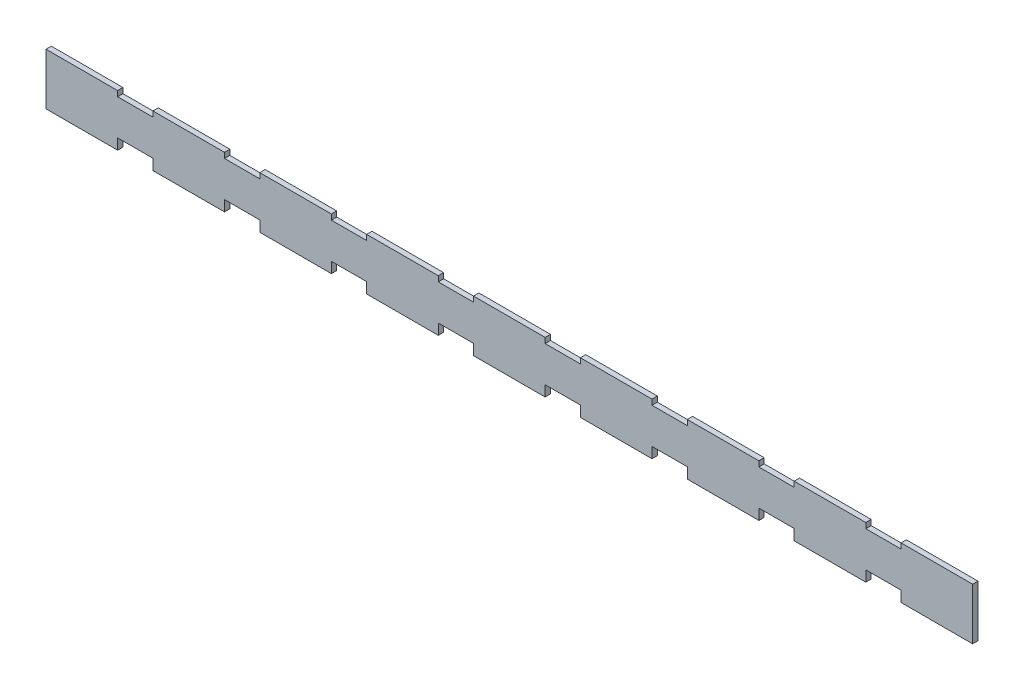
ISO-10303-21;
HEADER;
FILE_DESCRIPTION(('STEP AP214'),'2;1');
FILE_NAME('part.step','',(''),(''),'','','');
FILE_SCHEMA(('AUTOMOTIVE_DESIGN { 1 0 10303 214 1 1 1 1 }'));
ENDSEC;
DATA;
#1=APPLICATION_CONTEXT('core data for automotive mechanical design processes');
#2=APPLICATION_PROTOCOL_DEFINITION('international standard','automotive_design',2000,#1);
#3=PRODUCT_CONTEXT('',#1,'mechanical');
#4=PRODUCT('Part','Part','',(#3));
#5=PRODUCT_RELATED_PRODUCT_CATEGORY('part','',(#4));
#6=PRODUCT_DEFINITION_FORMATION('','',#4);
#7=PRODUCT_DEFINITION_CONTEXT('part definition',#1,'design');
#8=PRODUCT_DEFINITION('design','',#6,#7);
#9=PRODUCT_DEFINITION_SHAPE('','',#8);
#10=(LENGTH_UNIT() NAMED_UNIT(*) SI_UNIT(.MILLI.,.METRE.));
#11=(NAMED_UNIT(*) PLANE_ANGLE_UNIT() SI_UNIT($,.RADIAN.));
#12=(NAMED_UNIT(*) SI_UNIT($,.STERADIAN.) SOLID_ANGLE_UNIT());
#13=UNCERTAINTY_MEASURE_WITH_UNIT(LENGTH_MEASURE(1.E-05),#10,'distance_accuracy_value','');
#14=(GEOMETRIC_REPRESENTATION_CONTEXT(3) GLOBAL_UNCERTAINTY_ASSIGNED_CONTEXT((#13)) GLOBAL_UNIT_ASSIGNED_CONTEXT((#10,
#11,#12)) REPRESENTATION_CONTEXT('',''));
#15=CARTESIAN_POINT('',(0.,0.,0.));
#16=DIRECTION('',(0.,0.,1.));
#17=DIRECTION('',(1.,0.,0.));
#18=AXIS2_PLACEMENT_3D('',#15,#16,#17);
#19=CARTESIAN_POINT('',(-260.1,-10.,3.));
#20=DIRECTION('',(1.,0.,0.));
#21=DIRECTION('',(0.,0.,-1.));
#22=AXIS2_PLACEMENT_3D('',#19,#20,#21);
#23=PLANE('',#22);
#24=DIRECTION('',(0.,-1.,0.));
#25=VECTOR('',#24,1.);
#26=CARTESIAN_POINT('',(-260.1,-10.,0.));
#27=LINE('',#26,#25);
#28=CARTESIAN_POINT('',(-260.1,12.9999999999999,0.));
#29=VERTEX_POINT('',#28);
#30=CARTESIAN_POINT('',(-260.1,-16.,0.));
#31=VERTEX_POINT('',#30);
#32=EDGE_CURVE('E278',#29,#31,#27,.T.);
#33=ORIENTED_EDGE('',*,*,#32,.T.);
#34=DIRECTION('',(0.,0.,-1.));
#35=VECTOR('',#34,1.);
#36=CARTESIAN_POINT('',(-260.1,-16.,3.));
#37=LINE('',#36,#35);
#38=CARTESIAN_POINT('',(-260.1,-16.,3.));
#39=VERTEX_POINT('',#38);
#40=EDGE_CURVE('E11',#39,#31,#37,.T.);
#41=ORIENTED_EDGE('',*,*,#40,.F.);
#42=DIRECTION('',(0.,-1.,0.));
#43=VECTOR('',#42,1.);
#44=CARTESIAN_POINT('',(-260.1,9.99999999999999,3.));
#45=LINE('',#44,#43);
#46=CARTESIAN_POINT('',(-260.1,12.9999999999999,3.));
#47=VERTEX_POINT('',#46);
#48=EDGE_CURVE('E284',#47,#39,#45,.T.);
#49=ORIENTED_EDGE('',*,*,#48,.F.);
#50=DIRECTION('',(0.,0.,-1.));
#51=VECTOR('',#50,1.);
#52=CARTESIAN_POINT('',(-260.1,12.9999999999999,3.));
#53=LINE('',#52,#51);
#54=EDGE_CURVE('E502',#47,#29,#53,.T.);
#55=ORIENTED_EDGE('',*,*,#54,.T.);
#56=EDGE_LOOP('',(#33,#41,#49,#55));
#57=FACE_BOUND('',#56,.T.);
#58=ADVANCED_FACE('F45',(#57),#23,.F.);
#59=CARTESIAN_POINT('',(-260.1,-16.,3.));
#60=DIRECTION('',(0.,1.,0.));
#61=DIRECTION('',(0.,0.,1.));
#62=AXIS2_PLACEMENT_3D('',#59,#60,#61);
#63=PLANE('',#62);
#64=DIRECTION('',(1.,0.,0.));
#65=VECTOR('',#64,1.);
#66=CARTESIAN_POINT('',(-260.1,-16.,0.));
#67=LINE('',#66,#65);
#68=CARTESIAN_POINT('',(-219.9,-16.,0.));
#69=VERTEX_POINT('',#68);
#70=EDGE_CURVE('E508',#31,#69,#67,.T.);
#71=ORIENTED_EDGE('',*,*,#70,.T.);
#72=DIRECTION('',(0.,0.,-1.));
#73=VECTOR('',#72,1.);
#74=CARTESIAN_POINT('',(-219.9,-16.,3.));
#75=LINE('',#74,#73);
#76=CARTESIAN_POINT('',(-219.9,-16.,3.));
#77=VERTEX_POINT('',#76);
#78=EDGE_CURVE('E54',#77,#69,#75,.T.);
#79=ORIENTED_EDGE('',*,*,#78,.F.);
#80=DIRECTION('',(1.,0.,0.));
#81=VECTOR('',#80,1.);
#82=CARTESIAN_POINT('',(-260.1,-16.,3.));
#83=LINE('',#82,#81);
#84=EDGE_CURVE('E1185',#39,#77,#83,.T.);
#85=ORIENTED_EDGE('',*,*,#84,.F.);
#86=ORIENTED_EDGE('',*,*,#40,.T.);
#87=EDGE_LOOP('',(#71,#79,#85,#86));
#88=FACE_BOUND('',#87,.T.);
#89=ADVANCED_FACE('F1190',(#88),#63,.F.);
#90=CARTESIAN_POINT('',(-219.9,-10.,3.));
#91=DIRECTION('',(-1.,0.,0.));
#92=DIRECTION('',(0.,0.,1.));
#93=AXIS2_PLACEMENT_3D('',#90,#91,#92);
#94=PLANE('',#93);
#95=DIRECTION('',(0.,1.,0.));
#96=VECTOR('',#95,1.);
#97=CARTESIAN_POINT('',(-219.9,-10.,0.));
#98=LINE('',#97,#96);
#99=CARTESIAN_POINT('',(-219.9,-10.,0.));
#100=VERTEX_POINT('',#99);
#101=EDGE_CURVE('E511',#69,#100,#98,.T.);
#102=ORIENTED_EDGE('',*,*,#101,.T.);
#103=DIRECTION('',(0.,0.,-1.));
#104=VECTOR('',#103,1.);
#105=CARTESIAN_POINT('',(-219.9,-10.,3.));
#106=LINE('',#105,#104);
#107=CARTESIAN_POINT('',(-219.9,-10.,3.));
#108=VERTEX_POINT('',#107);
#109=EDGE_CURVE('E959',#108,#100,#106,.T.);
#110=ORIENTED_EDGE('',*,*,#109,.F.);
#111=DIRECTION('',(0.,1.,0.));
#112=VECTOR('',#111,1.);
#113=CARTESIAN_POINT('',(-219.9,-10.,3.));
#114=LINE('',#113,#112);
#115=EDGE_CURVE('E970',#77,#108,#114,.T.);
#116=ORIENTED_EDGE('',*,*,#115,.F.);
#117=ORIENTED_EDGE('',*,*,#78,.T.);
#118=EDGE_LOOP('',(#102,#110,#116,#117));
#119=FACE_BOUND('',#118,.T.);
#120=ADVANCED_FACE('F968',(#119),#94,.F.);
#121=CARTESIAN_POINT('',(-200.1,-10.,3.));
#122=DIRECTION('',(0.,1.,0.));
#123=DIRECTION('',(-1.,0.,0.));
#124=AXIS2_PLACEMENT_3D('',#121,#122,#123);
#125=PLANE('',#124);
#126=DIRECTION('',(1.,0.,0.));
#127=VECTOR('',#126,1.);
#128=CARTESIAN_POINT('',(-200.1,-10.,0.));
#129=LINE('',#128,#127);
#130=CARTESIAN_POINT('',(-200.1,-10.,0.));
#131=VERTEX_POINT('',#130);
#132=EDGE_CURVE('E514',#100,#131,#129,.T.);
#133=ORIENTED_EDGE('',*,*,#132,.T.);
#134=DIRECTION('',(0.,0.,-1.));
#135=VECTOR('',#134,1.);
#136=CARTESIAN_POINT('',(-200.1,-10.,3.));
#137=LINE('',#136,#135);
#138=CARTESIAN_POINT('',(-200.1,-10.,3.));
#139=VERTEX_POINT('',#138);
#140=EDGE_CURVE('E955',#139,#131,#137,.T.);
#141=ORIENTED_EDGE('',*,*,#140,.F.);
#142=DIRECTION('',(1.,0.,0.));
#143=VECTOR('',#142,1.);
#144=CARTESIAN_POINT('',(-200.1,-10.,3.));
#145=LINE('',#144,#143);
#146=EDGE_CURVE('E989',#108,#139,#145,.T.);
#147=ORIENTED_EDGE('',*,*,#146,.F.);
#148=ORIENTED_EDGE('',*,*,#109,.T.);
#149=EDGE_LOOP('',(#133,#141,#147,#148));
#150=FACE_BOUND('',#149,.T.);
#151=ADVANCED_FACE('F979',(#150),#125,.F.);
#152=CARTESIAN_POINT('',(-200.1,-10.,3.));
#153=DIRECTION('',(1.,0.,0.));
#154=DIRECTION('',(0.,0.,-1.));
#155=AXIS2_PLACEMENT_3D('',#152,#153,#154);
#156=PLANE('',#155);
#157=DIRECTION('',(0.,-1.,0.));
#158=VECTOR('',#157,1.);
#159=CARTESIAN_POINT('',(-200.1,-10.,0.));
#160=LINE('',#159,#158);
#161=CARTESIAN_POINT('',(-200.1,-16.,0.));
#162=VERTEX_POINT('',#161);
#163=EDGE_CURVE('E517',#131,#162,#160,.T.);
#164=ORIENTED_EDGE('',*,*,#163,.T.);
#165=DIRECTION('',(0.,0.,-1.));
#166=VECTOR('',#165,1.);
#167=CARTESIAN_POINT('',(-200.1,-16.,3.));
#168=LINE('',#167,#166);
#169=CARTESIAN_POINT('',(-200.1,-16.,3.));
#170=VERTEX_POINT('',#169);
#171=EDGE_CURVE('E951',#170,#162,#168,.T.);
#172=ORIENTED_EDGE('',*,*,#171,.F.);
#173=DIRECTION('',(0.,-1.,0.));
#174=VECTOR('',#173,1.);
#175=CARTESIAN_POINT('',(-200.1,-10.,3.));
#176=LINE('',#175,#174);
#177=EDGE_CURVE('E985',#139,#170,#176,.T.);
#178=ORIENTED_EDGE('',*,*,#177,.F.);
#179=ORIENTED_EDGE('',*,*,#140,.T.);
#180=EDGE_LOOP('',(#164,#172,#178,#179));
#181=FACE_BOUND('',#180,.T.);
#182=ADVANCED_FACE('F983',(#181),#156,.F.);
#183=CARTESIAN_POINT('',(-200.1,-16.,3.));
#184=DIRECTION('',(0.,1.,0.));
#185=DIRECTION('',(0.,0.,1.));
#186=AXIS2_PLACEMENT_3D('',#183,#184,#185);
#187=PLANE('',#186);
#188=DIRECTION('',(1.,0.,0.));
#189=VECTOR('',#188,1.);
#190=CARTESIAN_POINT('',(-200.1,-16.,0.));
#191=LINE('',#190,#189);
#192=CARTESIAN_POINT('',(-159.9,-16.,0.));
#193=VERTEX_POINT('',#192);
#194=EDGE_CURVE('E520',#162,#193,#191,.T.);
#195=ORIENTED_EDGE('',*,*,#194,.T.);
#196=DIRECTION('',(0.,0.,-1.));
#197=VECTOR('',#196,1.);
#198=CARTESIAN_POINT('',(-159.9,-16.,3.));
#199=LINE('',#198,#197);
#200=CARTESIAN_POINT('',(-159.9,-16.,3.));
#201=VERTEX_POINT('',#200);
#202=EDGE_CURVE('E947',#201,#193,#199,.T.);
#203=ORIENTED_EDGE('',*,*,#202,.F.);
#204=DIRECTION('',(1.,0.,0.));
#205=VECTOR('',#204,1.);
#206=CARTESIAN_POINT('',(-200.1,-16.,3.));
#207=LINE('',#206,#205);
#208=EDGE_CURVE('E988',#170,#201,#207,.T.);
#209=ORIENTED_EDGE('',*,*,#208,.F.);
#210=ORIENTED_EDGE('',*,*,#171,.T.);
#211=EDGE_LOOP('',(#195,#203,#209,#210));
#212=FACE_BOUND('',#211,.T.);
#213=ADVANCED_FACE('F1202',(#212),#187,.F.);
#214=CARTESIAN_POINT('',(-159.9,-10.,3.));
#215=DIRECTION('',(-1.,0.,0.));
#216=DIRECTION('',(0.,0.,1.));
#217=AXIS2_PLACEMENT_3D('',#214,#215,#216);
#218=PLANE('',#217);
#219=DIRECTION('',(0.,1.,0.));
#220=VECTOR('',#219,1.);
#221=CARTESIAN_POINT('',(-159.9,-10.,0.));
#222=LINE('',#221,#220);
#223=CARTESIAN_POINT('',(-159.9,-10.,0.));
#224=VERTEX_POINT('',#223);
#225=EDGE_CURVE('E523',#193,#224,#222,.T.);
#226=ORIENTED_EDGE('',*,*,#225,.T.);
#227=DIRECTION('',(0.,0.,-1.));
#228=VECTOR('',#227,1.);
#229=CARTESIAN_POINT('',(-159.9,-10.,3.));
#230=LINE('',#229,#228);
#231=CARTESIAN_POINT('',(-159.9,-10.,3.));
#232=VERTEX_POINT('',#231);
#233=EDGE_CURVE('E943',#232,#224,#230,.T.);
#234=ORIENTED_EDGE('',*,*,#233,.F.);
#235=DIRECTION('',(0.,1.,0.));
#236=VECTOR('',#235,1.);
#237=CARTESIAN_POINT('',(-159.9,-10.,3.));
#238=LINE('',#237,#236);
#239=EDGE_CURVE('E993',#201,#232,#238,.T.);
#240=ORIENTED_EDGE('',*,*,#239,.F.);
#241=ORIENTED_EDGE('',*,*,#202,.T.);
#242=EDGE_LOOP('',(#226,#234,#240,#241));
#243=FACE_BOUND('',#242,.T.);
#244=ADVANCED_FACE('F1205',(#243),#218,.F.);
#245=CARTESIAN_POINT('',(-140.1,-10.,3.));
#246=DIRECTION('',(0.,1.,0.));
#247=DIRECTION('',(-1.,0.,0.));
#248=AXIS2_PLACEMENT_3D('',#245,#246,#247);
#249=PLANE('',#248);
#250=DIRECTION('',(1.,0.,0.));
#251=VECTOR('',#250,1.);
#252=CARTESIAN_POINT('',(-140.1,-10.,0.));
#253=LINE('',#252,#251);
#254=CARTESIAN_POINT('',(-140.1,-10.,0.));
#255=VERTEX_POINT('',#254);
#256=EDGE_CURVE('E526',#224,#255,#253,.T.);
#257=ORIENTED_EDGE('',*,*,#256,.T.);
#258=DIRECTION('',(0.,0.,-1.));
#259=VECTOR('',#258,1.);
#260=CARTESIAN_POINT('',(-140.1,-10.,3.));
#261=LINE('',#260,#259);
#262=CARTESIAN_POINT('',(-140.1,-10.,3.));
#263=VERTEX_POINT('',#262);
#264=EDGE_CURVE('E939',#263,#255,#261,.T.);
#265=ORIENTED_EDGE('',*,*,#264,.F.);
#266=DIRECTION('',(1.,0.,0.));
#267=VECTOR('',#266,1.);
#268=CARTESIAN_POINT('',(-140.1,-10.,3.));
#269=LINE('',#268,#267);
#270=EDGE_CURVE('E1000',#232,#263,#269,.T.);
#271=ORIENTED_EDGE('',*,*,#270,.F.);
#272=ORIENTED_EDGE('',*,*,#233,.T.);
#273=EDGE_LOOP('',(#257,#265,#271,#272));
#274=FACE_BOUND('',#273,.T.);
#275=ADVANCED_FACE('F1209',(#274),#249,.F.);
#276=CARTESIAN_POINT('',(-140.1,-10.,3.));
#277=DIRECTION('',(1.,0.,0.));
#278=DIRECTION('',(0.,0.,-1.));
#279=AXIS2_PLACEMENT_3D('',#276,#277,#278);
#280=PLANE('',#279);
#281=DIRECTION('',(0.,-1.,0.));
#282=VECTOR('',#281,1.);
#283=CARTESIAN_POINT('',(-140.1,-10.,0.));
#284=LINE('',#283,#282);
#285=CARTESIAN_POINT('',(-140.1,-16.,0.));
#286=VERTEX_POINT('',#285);
#287=EDGE_CURVE('E529',#255,#286,#284,.T.);
#288=ORIENTED_EDGE('',*,*,#287,.T.);
#289=DIRECTION('',(0.,0.,-1.));
#290=VECTOR('',#289,1.);
#291=CARTESIAN_POINT('',(-140.1,-16.,3.));
#292=LINE('',#291,#290);
#293=CARTESIAN_POINT('',(-140.1,-16.,3.));
#294=VERTEX_POINT('',#293);
#295=EDGE_CURVE('E935',#294,#286,#292,.T.);
#296=ORIENTED_EDGE('',*,*,#295,.F.);
#297=DIRECTION('',(0.,-1.,0.));
#298=VECTOR('',#297,1.);
#299=CARTESIAN_POINT('',(-140.1,-10.,3.));
#300=LINE('',#299,#298);
#301=EDGE_CURVE('E1003',#263,#294,#300,.T.);
#302=ORIENTED_EDGE('',*,*,#301,.F.);
#303=ORIENTED_EDGE('',*,*,#264,.T.);
#304=EDGE_LOOP('',(#288,#296,#302,#303));
#305=FACE_BOUND('',#304,.T.);
#306=ADVANCED_FACE('F1213',(#305),#280,.F.);
#307=CARTESIAN_POINT('',(-140.1,-16.,3.));
#308=DIRECTION('',(0.,1.,0.));
#309=DIRECTION('',(0.,0.,1.));
#310=AXIS2_PLACEMENT_3D('',#307,#308,#309);
#311=PLANE('',#310);
#312=DIRECTION('',(1.,0.,0.));
#313=VECTOR('',#312,1.);
#314=CARTESIAN_POINT('',(-140.1,-16.,0.));
#315=LINE('',#314,#313);
#316=CARTESIAN_POINT('',(-99.9,-16.,0.));
#317=VERTEX_POINT('',#316);
#318=EDGE_CURVE('E532',#286,#317,#315,.T.);
#319=ORIENTED_EDGE('',*,*,#318,.T.);
#320=DIRECTION('',(0.,0.,-1.));
#321=VECTOR('',#320,1.);
#322=CARTESIAN_POINT('',(-99.9,-16.,3.));
#323=LINE('',#322,#321);
#324=CARTESIAN_POINT('',(-99.9,-16.,3.));
#325=VERTEX_POINT('',#324);
#326=EDGE_CURVE('E931',#325,#317,#323,.T.);
#327=ORIENTED_EDGE('',*,*,#326,.F.);
#328=DIRECTION('',(1.,0.,0.));
#329=VECTOR('',#328,1.);
#330=CARTESIAN_POINT('',(-140.1,-16.,3.));
#331=LINE('',#330,#329);
#332=EDGE_CURVE('E1006',#294,#325,#331,.T.);
#333=ORIENTED_EDGE('',*,*,#332,.F.);
#334=ORIENTED_EDGE('',*,*,#295,.T.);
#335=EDGE_LOOP('',(#319,#327,#333,#334));
#336=FACE_BOUND('',#335,.T.);
#337=ADVANCED_FACE('F1217',(#336),#311,.F.);
#338=CARTESIAN_POINT('',(-99.9,-10.,3.));
#339=DIRECTION('',(-1.,0.,0.));
#340=DIRECTION('',(0.,0.,1.));
#341=AXIS2_PLACEMENT_3D('',#338,#339,#340);
#342=PLANE('',#341);
#343=DIRECTION('',(0.,1.,0.));
#344=VECTOR('',#343,1.);
#345=CARTESIAN_POINT('',(-99.9,-10.,0.));
#346=LINE('',#345,#344);
#347=CARTESIAN_POINT('',(-99.9,-10.,0.));
#348=VERTEX_POINT('',#347);
#349=EDGE_CURVE('E535',#317,#348,#346,.T.);
#350=ORIENTED_EDGE('',*,*,#349,.T.);
#351=DIRECTION('',(0.,0.,-1.));
#352=VECTOR('',#351,1.);
#353=CARTESIAN_POINT('',(-99.9,-10.,3.));
#354=LINE('',#353,#352);
#355=CARTESIAN_POINT('',(-99.9,-10.,3.));
#356=VERTEX_POINT('',#355);
#357=EDGE_CURVE('E927',#356,#348,#354,.T.);
#358=ORIENTED_EDGE('',*,*,#357,.F.);
#359=DIRECTION('',(0.,1.,0.));
#360=VECTOR('',#359,1.);
#361=CARTESIAN_POINT('',(-99.9,-10.,3.));
#362=LINE('',#361,#360);
#363=EDGE_CURVE('E1009',#325,#356,#362,.T.);
#364=ORIENTED_EDGE('',*,*,#363,.F.);
#365=ORIENTED_EDGE('',*,*,#326,.T.);
#366=EDGE_LOOP('',(#350,#358,#364,#365));
#367=FACE_BOUND('',#366,.T.);
#368=ADVANCED_FACE('F1221',(#367),#342,.F.);
#369=CARTESIAN_POINT('',(-80.1,-10.,3.));
#370=DIRECTION('',(0.,1.,0.));
#371=DIRECTION('',(-1.,0.,0.));
#372=AXIS2_PLACEMENT_3D('',#369,#370,#371);
#373=PLANE('',#372);
#374=DIRECTION('',(1.,0.,0.));
#375=VECTOR('',#374,1.);
#376=CARTESIAN_POINT('',(-80.1,-10.,0.));
#377=LINE('',#376,#375);
#378=CARTESIAN_POINT('',(-80.1,-10.,0.));
#379=VERTEX_POINT('',#378);
#380=EDGE_CURVE('E538',#348,#379,#377,.T.);
#381=ORIENTED_EDGE('',*,*,#380,.T.);
#382=DIRECTION('',(0.,0.,-1.));
#383=VECTOR('',#382,1.);
#384=CARTESIAN_POINT('',(-80.1,-10.,3.));
#385=LINE('',#384,#383);
#386=CARTESIAN_POINT('',(-80.1,-10.,3.));
#387=VERTEX_POINT('',#386);
#388=EDGE_CURVE('E923',#387,#379,#385,.T.);
#389=ORIENTED_EDGE('',*,*,#388,.F.);
#390=DIRECTION('',(1.,0.,0.));
#391=VECTOR('',#390,1.);
#392=CARTESIAN_POINT('',(-80.1,-10.,3.));
#393=LINE('',#392,#391);
#394=EDGE_CURVE('E1012',#356,#387,#393,.T.);
#395=ORIENTED_EDGE('',*,*,#394,.F.);
#396=ORIENTED_EDGE('',*,*,#357,.T.);
#397=EDGE_LOOP('',(#381,#389,#395,#396));
#398=FACE_BOUND('',#397,.T.);
#399=ADVANCED_FACE('F1225',(#398),#373,.F.);
#400=CARTESIAN_POINT('',(-80.1,-10.,3.));
#401=DIRECTION('',(1.,0.,0.));
#402=DIRECTION('',(0.,0.,-1.));
#403=AXIS2_PLACEMENT_3D('',#400,#401,#402);
#404=PLANE('',#403);
#405=DIRECTION('',(0.,-1.,0.));
#406=VECTOR('',#405,1.);
#407=CARTESIAN_POINT('',(-80.1,-10.,0.));
#408=LINE('',#407,#406);
#409=CARTESIAN_POINT('',(-80.1,-16.,0.));
#410=VERTEX_POINT('',#409);
#411=EDGE_CURVE('E541',#379,#410,#408,.T.);
#412=ORIENTED_EDGE('',*,*,#411,.T.);
#413=DIRECTION('',(0.,0.,-1.));
#414=VECTOR('',#413,1.);
#415=CARTESIAN_POINT('',(-80.1,-16.,3.));
#416=LINE('',#415,#414);
#417=CARTESIAN_POINT('',(-80.1,-16.,3.));
#418=VERTEX_POINT('',#417);
#419=EDGE_CURVE('E919',#418,#410,#416,.T.);
#420=ORIENTED_EDGE('',*,*,#419,.F.);
#421=DIRECTION('',(0.,-1.,0.));
#422=VECTOR('',#421,1.);
#423=CARTESIAN_POINT('',(-80.1,-10.,3.));
#424=LINE('',#423,#422);
#425=EDGE_CURVE('E1015',#387,#418,#424,.T.);
#426=ORIENTED_EDGE('',*,*,#425,.F.);
#427=ORIENTED_EDGE('',*,*,#388,.T.);
#428=EDGE_LOOP('',(#412,#420,#426,#427));
#429=FACE_BOUND('',#428,.T.);
#430=ADVANCED_FACE('F1229',(#429),#404,.F.);
#431=CARTESIAN_POINT('',(-80.1,-16.,3.));
#432=DIRECTION('',(0.,1.,0.));
#433=DIRECTION('',(0.,0.,1.));
#434=AXIS2_PLACEMENT_3D('',#431,#432,#433);
#435=PLANE('',#434);
#436=DIRECTION('',(1.,0.,0.));
#437=VECTOR('',#436,1.);
#438=CARTESIAN_POINT('',(-80.1,-16.,0.));
#439=LINE('',#438,#437);
#440=CARTESIAN_POINT('',(-39.9,-16.,0.));
#441=VERTEX_POINT('',#440);
#442=EDGE_CURVE('E544',#410,#441,#439,.T.);
#443=ORIENTED_EDGE('',*,*,#442,.T.);
#444=DIRECTION('',(0.,0.,-1.));
#445=VECTOR('',#444,1.);
#446=CARTESIAN_POINT('',(-39.9,-16.,3.));
#447=LINE('',#446,#445);
#448=CARTESIAN_POINT('',(-39.9,-16.,3.));
#449=VERTEX_POINT('',#448);
#450=EDGE_CURVE('E915',#449,#441,#447,.T.);
#451=ORIENTED_EDGE('',*,*,#450,.F.);
#452=DIRECTION('',(1.,0.,0.));
#453=VECTOR('',#452,1.);
#454=CARTESIAN_POINT('',(-80.1,-16.,3.));
#455=LINE('',#454,#453);
#456=EDGE_CURVE('E1018',#418,#449,#455,.T.);
#457=ORIENTED_EDGE('',*,*,#456,.F.);
#458=ORIENTED_EDGE('',*,*,#419,.T.);
#459=EDGE_LOOP('',(#443,#451,#457,#458));
#460=FACE_BOUND('',#459,.T.);
#461=ADVANCED_FACE('F1233',(#460),#435,.F.);
#462=CARTESIAN_POINT('',(-39.9,-10.,3.));
#463=DIRECTION('',(-1.,0.,0.));
#464=DIRECTION('',(0.,0.,1.));
#465=AXIS2_PLACEMENT_3D('',#462,#463,#464);
#466=PLANE('',#465);
#467=DIRECTION('',(0.,1.,0.));
#468=VECTOR('',#467,1.);
#469=CARTESIAN_POINT('',(-39.9,-10.,0.));
#470=LINE('',#469,#468);
#471=CARTESIAN_POINT('',(-39.9,-10.,0.));
#472=VERTEX_POINT('',#471);
#473=EDGE_CURVE('E547',#441,#472,#470,.T.);
#474=ORIENTED_EDGE('',*,*,#473,.T.);
#475=DIRECTION('',(0.,0.,-1.));
#476=VECTOR('',#475,1.);
#477=CARTESIAN_POINT('',(-39.9,-10.,3.));
#478=LINE('',#477,#476);
#479=CARTESIAN_POINT('',(-39.9,-10.,3.));
#480=VERTEX_POINT('',#479);
#481=EDGE_CURVE('E911',#480,#472,#478,.T.);
#482=ORIENTED_EDGE('',*,*,#481,.F.);
#483=DIRECTION('',(0.,1.,0.));
#484=VECTOR('',#483,1.);
#485=CARTESIAN_POINT('',(-39.9,-10.,3.));
#486=LINE('',#485,#484);
#487=EDGE_CURVE('E1021',#449,#480,#486,.T.);
#488=ORIENTED_EDGE('',*,*,#487,.F.);
#489=ORIENTED_EDGE('',*,*,#450,.T.);
#490=EDGE_LOOP('',(#474,#482,#488,#489));
#491=FACE_BOUND('',#490,.T.);
#492=ADVANCED_FACE('F1237',(#491),#466,.F.);
#493=CARTESIAN_POINT('',(-20.1,-10.,3.));
#494=DIRECTION('',(0.,1.,0.));
#495=DIRECTION('',(-1.,0.,0.));
#496=AXIS2_PLACEMENT_3D('',#493,#494,#495);
#497=PLANE('',#496);
#498=DIRECTION('',(1.,0.,0.));
#499=VECTOR('',#498,1.);
#500=CARTESIAN_POINT('',(-20.1,-10.,0.));
#501=LINE('',#500,#499);
#502=CARTESIAN_POINT('',(-20.1,-10.,0.));
#503=VERTEX_POINT('',#502);
#504=EDGE_CURVE('E550',#472,#503,#501,.T.);
#505=ORIENTED_EDGE('',*,*,#504,.T.);
#506=DIRECTION('',(0.,0.,-1.));
#507=VECTOR('',#506,1.);
#508=CARTESIAN_POINT('',(-20.1,-10.,3.));
#509=LINE('',#508,#507);
#510=CARTESIAN_POINT('',(-20.1,-10.,3.));
#511=VERTEX_POINT('',#510);
#512=EDGE_CURVE('E907',#511,#503,#509,.T.);
#513=ORIENTED_EDGE('',*,*,#512,.F.);
#514=DIRECTION('',(1.,0.,0.));
#515=VECTOR('',#514,1.);
#516=CARTESIAN_POINT('',(-20.1,-10.,3.));
#517=LINE('',#516,#515);
#518=EDGE_CURVE('E1024',#480,#511,#517,.T.);
#519=ORIENTED_EDGE('',*,*,#518,.F.);
#520=ORIENTED_EDGE('',*,*,#481,.T.);
#521=EDGE_LOOP('',(#505,#513,#519,#520));
#522=FACE_BOUND('',#521,.T.);
#523=ADVANCED_FACE('F1241',(#522),#497,.F.);
#524=CARTESIAN_POINT('',(-20.1,-10.,3.));
#525=DIRECTION('',(1.,0.,0.));
#526=DIRECTION('',(0.,0.,-1.));
#527=AXIS2_PLACEMENT_3D('',#524,#525,#526);
#528=PLANE('',#527);
#529=DIRECTION('',(0.,-1.,0.));
#530=VECTOR('',#529,1.);
#531=CARTESIAN_POINT('',(-20.1,-10.,0.));
#532=LINE('',#531,#530);
#533=CARTESIAN_POINT('',(-20.1,-16.,0.));
#534=VERTEX_POINT('',#533);
#535=EDGE_CURVE('E553',#503,#534,#532,.T.);
#536=ORIENTED_EDGE('',*,*,#535,.T.);
#537=DIRECTION('',(0.,0.,-1.));
#538=VECTOR('',#537,1.);
#539=CARTESIAN_POINT('',(-20.1,-16.,3.));
#540=LINE('',#539,#538);
#541=CARTESIAN_POINT('',(-20.1,-16.,3.));
#542=VERTEX_POINT('',#541);
#543=EDGE_CURVE('E903',#542,#534,#540,.T.);
#544=ORIENTED_EDGE('',*,*,#543,.F.);
#545=DIRECTION('',(0.,-1.,0.));
#546=VECTOR('',#545,1.);
#547=CARTESIAN_POINT('',(-20.1,-10.,3.));
#548=LINE('',#547,#546);
#549=EDGE_CURVE('E1027',#511,#542,#548,.T.);
#550=ORIENTED_EDGE('',*,*,#549,.F.);
#551=ORIENTED_EDGE('',*,*,#512,.T.);
#552=EDGE_LOOP('',(#536,#544,#550,#551));
#553=FACE_BOUND('',#552,.T.);
#554=ADVANCED_FACE('F1245',(#553),#528,.F.);
#555=CARTESIAN_POINT('',(-20.1,-16.,3.));
#556=DIRECTION('',(0.,1.,0.));
#557=DIRECTION('',(0.,0.,1.));
#558=AXIS2_PLACEMENT_3D('',#555,#556,#557);
#559=PLANE('',#558);
#560=DIRECTION('',(1.,0.,0.));
#561=VECTOR('',#560,1.);
#562=CARTESIAN_POINT('',(-20.1,-16.,0.));
#563=LINE('',#562,#561);
#564=CARTESIAN_POINT('',(20.1,-16.,0.));
#565=VERTEX_POINT('',#564);
#566=EDGE_CURVE('E556',#534,#565,#563,.T.);
#567=ORIENTED_EDGE('',*,*,#566,.T.);
#568=DIRECTION('',(0.,0.,-1.));
#569=VECTOR('',#568,1.);
#570=CARTESIAN_POINT('',(20.1,-16.,3.));
#571=LINE('',#570,#569);
#572=CARTESIAN_POINT('',(20.1,-16.,3.));
#573=VERTEX_POINT('',#572);
#574=EDGE_CURVE('E899',#573,#565,#571,.T.);
#575=ORIENTED_EDGE('',*,*,#574,.F.);
#576=DIRECTION('',(1.,0.,0.));
#577=VECTOR('',#576,1.);
#578=CARTESIAN_POINT('',(-20.1,-16.,3.));
#579=LINE('',#578,#577);
#580=EDGE_CURVE('E1030',#542,#573,#579,.T.);
#581=ORIENTED_EDGE('',*,*,#580,.F.);
#582=ORIENTED_EDGE('',*,*,#543,.T.);
#583=EDGE_LOOP('',(#567,#575,#581,#582));
#584=FACE_BOUND('',#583,.T.);
#585=ADVANCED_FACE('F1249',(#584),#559,.F.);
#586=CARTESIAN_POINT('',(20.1,-10.,3.));
#587=DIRECTION('',(-1.,0.,0.));
#588=DIRECTION('',(0.,0.,1.));
#589=AXIS2_PLACEMENT_3D('',#586,#587,#588);
#590=PLANE('',#589);
#591=DIRECTION('',(0.,1.,0.));
#592=VECTOR('',#591,1.);
#593=CARTESIAN_POINT('',(20.1,-10.,0.));
#594=LINE('',#593,#592);
#595=CARTESIAN_POINT('',(20.1,-10.,0.));
#596=VERTEX_POINT('',#595);
#597=EDGE_CURVE('E559',#565,#596,#594,.T.);
#598=ORIENTED_EDGE('',*,*,#597,.T.);
#599=DIRECTION('',(0.,0.,-1.));
#600=VECTOR('',#599,1.);
#601=CARTESIAN_POINT('',(20.1,-10.,3.));
#602=LINE('',#601,#600);
#603=CARTESIAN_POINT('',(20.1,-10.,3.));
#604=VERTEX_POINT('',#603);
#605=EDGE_CURVE('E895',#604,#596,#602,.T.);
#606=ORIENTED_EDGE('',*,*,#605,.F.);
#607=DIRECTION('',(0.,1.,0.));
#608=VECTOR('',#607,1.);
#609=CARTESIAN_POINT('',(20.1,-10.,3.));
#610=LINE('',#609,#608);
#611=EDGE_CURVE('E1033',#573,#604,#610,.T.);
#612=ORIENTED_EDGE('',*,*,#611,.F.);
#613=ORIENTED_EDGE('',*,*,#574,.T.);
#614=EDGE_LOOP('',(#598,#606,#612,#613));
#615=FACE_BOUND('',#614,.T.);
#616=ADVANCED_FACE('F1253',(#615),#590,.F.);
#617=CARTESIAN_POINT('',(39.9,-10.,3.));
#618=DIRECTION('',(0.,1.,0.));
#619=DIRECTION('',(-1.,0.,0.));
#620=AXIS2_PLACEMENT_3D('',#617,#618,#619);
#621=PLANE('',#620);
#622=DIRECTION('',(1.,0.,0.));
#623=VECTOR('',#622,1.);
#624=CARTESIAN_POINT('',(39.9,-10.,0.));
#625=LINE('',#624,#623);
#626=CARTESIAN_POINT('',(39.9,-10.,0.));
#627=VERTEX_POINT('',#626);
#628=EDGE_CURVE('E562',#596,#627,#625,.T.);
#629=ORIENTED_EDGE('',*,*,#628,.T.);
#630=DIRECTION('',(0.,0.,-1.));
#631=VECTOR('',#630,1.);
#632=CARTESIAN_POINT('',(39.9,-10.,3.));
#633=LINE('',#632,#631);
#634=CARTESIAN_POINT('',(39.9,-10.,3.));
#635=VERTEX_POINT('',#634);
#636=EDGE_CURVE('E891',#635,#627,#633,.T.);
#637=ORIENTED_EDGE('',*,*,#636,.F.);
#638=DIRECTION('',(1.,0.,0.));
#639=VECTOR('',#638,1.);
#640=CARTESIAN_POINT('',(39.9,-10.,3.));
#641=LINE('',#640,#639);
#642=EDGE_CURVE('E1036',#604,#635,#641,.T.);
#643=ORIENTED_EDGE('',*,*,#642,.F.);
#644=ORIENTED_EDGE('',*,*,#605,.T.);
#645=EDGE_LOOP('',(#629,#637,#643,#644));
#646=FACE_BOUND('',#645,.T.);
#647=ADVANCED_FACE('F1257',(#646),#621,.F.);
#648=CARTESIAN_POINT('',(39.9,-10.,3.));
#649=DIRECTION('',(1.,0.,0.));
#650=DIRECTION('',(0.,0.,-1.));
#651=AXIS2_PLACEMENT_3D('',#648,#649,#650);
#652=PLANE('',#651);
#653=DIRECTION('',(0.,-1.,0.));
#654=VECTOR('',#653,1.);
#655=CARTESIAN_POINT('',(39.9,-10.,0.));
#656=LINE('',#655,#654);
#657=CARTESIAN_POINT('',(39.9,-16.,0.));
#658=VERTEX_POINT('',#657);
#659=EDGE_CURVE('E565',#627,#658,#656,.T.);
#660=ORIENTED_EDGE('',*,*,#659,.T.);
#661=DIRECTION('',(0.,0.,-1.));
#662=VECTOR('',#661,1.);
#663=CARTESIAN_POINT('',(39.9,-16.,3.));
#664=LINE('',#663,#662);
#665=CARTESIAN_POINT('',(39.9,-16.,3.));
#666=VERTEX_POINT('',#665);
#667=EDGE_CURVE('E887',#666,#658,#664,.T.);
#668=ORIENTED_EDGE('',*,*,#667,.F.);
#669=DIRECTION('',(0.,-1.,0.));
#670=VECTOR('',#669,1.);
#671=CARTESIAN_POINT('',(39.9,-10.,3.));
#672=LINE('',#671,#670);
#673=EDGE_CURVE('E1039',#635,#666,#672,.T.);
#674=ORIENTED_EDGE('',*,*,#673,.F.);
#675=ORIENTED_EDGE('',*,*,#636,.T.);
#676=EDGE_LOOP('',(#660,#668,#674,#675));
#677=FACE_BOUND('',#676,.T.);
#678=ADVANCED_FACE('F1261',(#677),#652,.F.);
#679=CARTESIAN_POINT('',(39.9,-16.,3.));
#680=DIRECTION('',(0.,1.,0.));
#681=DIRECTION('',(0.,0.,1.));
#682=AXIS2_PLACEMENT_3D('',#679,#680,#681);
#683=PLANE('',#682);
#684=DIRECTION('',(1.,0.,0.));
#685=VECTOR('',#684,1.);
#686=CARTESIAN_POINT('',(39.9,-16.,0.));
#687=LINE('',#686,#685);
#688=CARTESIAN_POINT('',(80.1,-16.,0.));
#689=VERTEX_POINT('',#688);
#690=EDGE_CURVE('E568',#658,#689,#687,.T.);
#691=ORIENTED_EDGE('',*,*,#690,.T.);
#692=DIRECTION('',(0.,0.,-1.));
#693=VECTOR('',#692,1.);
#694=CARTESIAN_POINT('',(80.1,-16.,3.));
#695=LINE('',#694,#693);
#696=CARTESIAN_POINT('',(80.1,-16.,3.));
#697=VERTEX_POINT('',#696);
#698=EDGE_CURVE('E883',#697,#689,#695,.T.);
#699=ORIENTED_EDGE('',*,*,#698,.F.);
#700=DIRECTION('',(1.,0.,0.));
#701=VECTOR('',#700,1.);
#702=CARTESIAN_POINT('',(39.9,-16.,3.));
#703=LINE('',#702,#701);
#704=EDGE_CURVE('E1042',#666,#697,#703,.T.);
#705=ORIENTED_EDGE('',*,*,#704,.F.);
#706=ORIENTED_EDGE('',*,*,#667,.T.);
#707=EDGE_LOOP('',(#691,#699,#705,#706));
#708=FACE_BOUND('',#707,.T.);
#709=ADVANCED_FACE('F1265',(#708),#683,.F.);
#710=CARTESIAN_POINT('',(80.1,-10.,3.));
#711=DIRECTION('',(-1.,0.,0.));
#712=DIRECTION('',(0.,0.,1.));
#713=AXIS2_PLACEMENT_3D('',#710,#711,#712);
#714=PLANE('',#713);
#715=DIRECTION('',(0.,1.,0.));
#716=VECTOR('',#715,1.);
#717=CARTESIAN_POINT('',(80.1,-10.,0.));
#718=LINE('',#717,#716);
#719=CARTESIAN_POINT('',(80.1,-10.,0.));
#720=VERTEX_POINT('',#719);
#721=EDGE_CURVE('E571',#689,#720,#718,.T.);
#722=ORIENTED_EDGE('',*,*,#721,.T.);
#723=DIRECTION('',(0.,0.,-1.));
#724=VECTOR('',#723,1.);
#725=CARTESIAN_POINT('',(80.1,-10.,3.));
#726=LINE('',#725,#724);
#727=CARTESIAN_POINT('',(80.1,-10.,3.));
#728=VERTEX_POINT('',#727);
#729=EDGE_CURVE('E879',#728,#720,#726,.T.);
#730=ORIENTED_EDGE('',*,*,#729,.F.);
#731=DIRECTION('',(0.,1.,0.));
#732=VECTOR('',#731,1.);
#733=CARTESIAN_POINT('',(80.1,-10.,3.));
#734=LINE('',#733,#732);
#735=EDGE_CURVE('E1045',#697,#728,#734,.T.);
#736=ORIENTED_EDGE('',*,*,#735,.F.);
#737=ORIENTED_EDGE('',*,*,#698,.T.);
#738=EDGE_LOOP('',(#722,#730,#736,#737));
#739=FACE_BOUND('',#738,.T.);
#740=ADVANCED_FACE('F1269',(#739),#714,.F.);
#741=CARTESIAN_POINT('',(99.9,-10.,3.));
#742=DIRECTION('',(0.,1.,0.));
#743=DIRECTION('',(-1.,0.,0.));
#744=AXIS2_PLACEMENT_3D('',#741,#742,#743);
#745=PLANE('',#744);
#746=DIRECTION('',(1.,0.,0.));
#747=VECTOR('',#746,1.);
#748=CARTESIAN_POINT('',(99.9,-10.,0.));
#749=LINE('',#748,#747);
#750=CARTESIAN_POINT('',(99.9,-10.,0.));
#751=VERTEX_POINT('',#750);
#752=EDGE_CURVE('E574',#720,#751,#749,.T.);
#753=ORIENTED_EDGE('',*,*,#752,.T.);
#754=DIRECTION('',(0.,0.,-1.));
#755=VECTOR('',#754,1.);
#756=CARTESIAN_POINT('',(99.9,-10.,3.));
#757=LINE('',#756,#755);
#758=CARTESIAN_POINT('',(99.9,-10.,3.));
#759=VERTEX_POINT('',#758);
#760=EDGE_CURVE('E875',#759,#751,#757,.T.);
#761=ORIENTED_EDGE('',*,*,#760,.F.);
#762=DIRECTION('',(1.,0.,0.));
#763=VECTOR('',#762,1.);
#764=CARTESIAN_POINT('',(99.9,-10.,3.));
#765=LINE('',#764,#763);
#766=EDGE_CURVE('E1048',#728,#759,#765,.T.);
#767=ORIENTED_EDGE('',*,*,#766,.F.);
#768=ORIENTED_EDGE('',*,*,#729,.T.);
#769=EDGE_LOOP('',(#753,#761,#767,#768));
#770=FACE_BOUND('',#769,.T.);
#771=ADVANCED_FACE('F1273',(#770),#745,.F.);
#772=CARTESIAN_POINT('',(99.9,-10.,3.));
#773=DIRECTION('',(1.,0.,0.));
#774=DIRECTION('',(0.,0.,-1.));
#775=AXIS2_PLACEMENT_3D('',#772,#773,#774);
#776=PLANE('',#775);
#777=DIRECTION('',(0.,-1.,0.));
#778=VECTOR('',#777,1.);
#779=CARTESIAN_POINT('',(99.9,-10.,0.));
#780=LINE('',#779,#778);
#781=CARTESIAN_POINT('',(99.9,-16.,0.));
#782=VERTEX_POINT('',#781);
#783=EDGE_CURVE('E577',#751,#782,#780,.T.);
#784=ORIENTED_EDGE('',*,*,#783,.T.);
#785=DIRECTION('',(0.,0.,-1.));
#786=VECTOR('',#785,1.);
#787=CARTESIAN_POINT('',(99.9,-16.,3.));
#788=LINE('',#787,#786);
#789=CARTESIAN_POINT('',(99.9,-16.,3.));
#790=VERTEX_POINT('',#789);
#791=EDGE_CURVE('E871',#790,#782,#788,.T.);
#792=ORIENTED_EDGE('',*,*,#791,.F.);
#793=DIRECTION('',(0.,-1.,0.));
#794=VECTOR('',#793,1.);
#795=CARTESIAN_POINT('',(99.9,-10.,3.));
#796=LINE('',#795,#794);
#797=EDGE_CURVE('E1051',#759,#790,#796,.T.);
#798=ORIENTED_EDGE('',*,*,#797,.F.);
#799=ORIENTED_EDGE('',*,*,#760,.T.);
#800=EDGE_LOOP('',(#784,#792,#798,#799));
#801=FACE_BOUND('',#800,.T.);
#802=ADVANCED_FACE('F1277',(#801),#776,.F.);
#803=CARTESIAN_POINT('',(99.9,-16.,3.));
#804=DIRECTION('',(0.,1.,0.));
#805=DIRECTION('',(0.,0.,1.));
#806=AXIS2_PLACEMENT_3D('',#803,#804,#805);
#807=PLANE('',#806);
#808=DIRECTION('',(1.,0.,0.));
#809=VECTOR('',#808,1.);
#810=CARTESIAN_POINT('',(99.9,-16.,0.));
#811=LINE('',#810,#809);
#812=CARTESIAN_POINT('',(140.1,-16.,0.));
#813=VERTEX_POINT('',#812);
#814=EDGE_CURVE('E580',#782,#813,#811,.T.);
#815=ORIENTED_EDGE('',*,*,#814,.T.);
#816=DIRECTION('',(0.,0.,-1.));
#817=VECTOR('',#816,1.);
#818=CARTESIAN_POINT('',(140.1,-16.,3.));
#819=LINE('',#818,#817);
#820=CARTESIAN_POINT('',(140.1,-16.,3.));
#821=VERTEX_POINT('',#820);
#822=EDGE_CURVE('E867',#821,#813,#819,.T.);
#823=ORIENTED_EDGE('',*,*,#822,.F.);
#824=DIRECTION('',(1.,0.,0.));
#825=VECTOR('',#824,1.);
#826=CARTESIAN_POINT('',(99.9,-16.,3.));
#827=LINE('',#826,#825);
#828=EDGE_CURVE('E1054',#790,#821,#827,.T.);
#829=ORIENTED_EDGE('',*,*,#828,.F.);
#830=ORIENTED_EDGE('',*,*,#791,.T.);
#831=EDGE_LOOP('',(#815,#823,#829,#830));
#832=FACE_BOUND('',#831,.T.);
#833=ADVANCED_FACE('F1281',(#832),#807,.F.);
#834=CARTESIAN_POINT('',(140.1,-10.,3.));
#835=DIRECTION('',(-1.,0.,0.));
#836=DIRECTION('',(0.,0.,1.));
#837=AXIS2_PLACEMENT_3D('',#834,#835,#836);
#838=PLANE('',#837);
#839=DIRECTION('',(0.,1.,0.));
#840=VECTOR('',#839,1.);
#841=CARTESIAN_POINT('',(140.1,-10.,0.));
#842=LINE('',#841,#840);
#843=CARTESIAN_POINT('',(140.1,-10.,0.));
#844=VERTEX_POINT('',#843);
#845=EDGE_CURVE('E583',#813,#844,#842,.T.);
#846=ORIENTED_EDGE('',*,*,#845,.T.);
#847=DIRECTION('',(0.,0.,-1.));
#848=VECTOR('',#847,1.);
#849=CARTESIAN_POINT('',(140.1,-10.,3.));
#850=LINE('',#849,#848);
#851=CARTESIAN_POINT('',(140.1,-10.,3.));
#852=VERTEX_POINT('',#851);
#853=EDGE_CURVE('E863',#852,#844,#850,.T.);
#854=ORIENTED_EDGE('',*,*,#853,.F.);
#855=DIRECTION('',(0.,1.,0.));
#856=VECTOR('',#855,1.);
#857=CARTESIAN_POINT('',(140.1,-10.,3.));
#858=LINE('',#857,#856);
#859=EDGE_CURVE('E1057',#821,#852,#858,.T.);
#860=ORIENTED_EDGE('',*,*,#859,.F.);
#861=ORIENTED_EDGE('',*,*,#822,.T.);
#862=EDGE_LOOP('',(#846,#854,#860,#861));
#863=FACE_BOUND('',#862,.T.);
#864=ADVANCED_FACE('F1285',(#863),#838,.F.);
#865=CARTESIAN_POINT('',(159.9,-10.,3.));
#866=DIRECTION('',(0.,1.,0.));
#867=DIRECTION('',(-1.,0.,0.));
#868=AXIS2_PLACEMENT_3D('',#865,#866,#867);
#869=PLANE('',#868);
#870=DIRECTION('',(1.,0.,0.));
#871=VECTOR('',#870,1.);
#872=CARTESIAN_POINT('',(159.9,-10.,0.));
#873=LINE('',#872,#871);
#874=CARTESIAN_POINT('',(159.9,-10.,0.));
#875=VERTEX_POINT('',#874);
#876=EDGE_CURVE('E586',#844,#875,#873,.T.);
#877=ORIENTED_EDGE('',*,*,#876,.T.);
#878=DIRECTION('',(0.,0.,-1.));
#879=VECTOR('',#878,1.);
#880=CARTESIAN_POINT('',(159.9,-10.,3.));
#881=LINE('',#880,#879);
#882=CARTESIAN_POINT('',(159.9,-10.,3.));
#883=VERTEX_POINT('',#882);
#884=EDGE_CURVE('E859',#883,#875,#881,.T.);
#885=ORIENTED_EDGE('',*,*,#884,.F.);
#886=DIRECTION('',(1.,0.,0.));
#887=VECTOR('',#886,1.);
#888=CARTESIAN_POINT('',(159.9,-10.,3.));
#889=LINE('',#888,#887);
#890=EDGE_CURVE('E1060',#852,#883,#889,.T.);
#891=ORIENTED_EDGE('',*,*,#890,.F.);
#892=ORIENTED_EDGE('',*,*,#853,.T.);
#893=EDGE_LOOP('',(#877,#885,#891,#892));
#894=FACE_BOUND('',#893,.T.);
#895=ADVANCED_FACE('F1289',(#894),#869,.F.);
#896=CARTESIAN_POINT('',(159.9,-10.,3.));
#897=DIRECTION('',(1.,0.,0.));
#898=DIRECTION('',(0.,0.,-1.));
#899=AXIS2_PLACEMENT_3D('',#896,#897,#898);
#900=PLANE('',#899);
#901=DIRECTION('',(0.,-1.,0.));
#902=VECTOR('',#901,1.);
#903=CARTESIAN_POINT('',(159.9,-10.,0.));
#904=LINE('',#903,#902);
#905=CARTESIAN_POINT('',(159.9,-16.,0.));
#906=VERTEX_POINT('',#905);
#907=EDGE_CURVE('E589',#875,#906,#904,.T.);
#908=ORIENTED_EDGE('',*,*,#907,.T.);
#909=DIRECTION('',(0.,0.,-1.));
#910=VECTOR('',#909,1.);
#911=CARTESIAN_POINT('',(159.9,-16.,3.));
#912=LINE('',#911,#910);
#913=CARTESIAN_POINT('',(159.9,-16.,3.));
#914=VERTEX_POINT('',#913);
#915=EDGE_CURVE('E855',#914,#906,#912,.T.);
#916=ORIENTED_EDGE('',*,*,#915,.F.);
#917=DIRECTION('',(0.,-1.,0.));
#918=VECTOR('',#917,1.);
#919=CARTESIAN_POINT('',(159.9,-10.,3.));
#920=LINE('',#919,#918);
#921=EDGE_CURVE('E1063',#883,#914,#920,.T.);
#922=ORIENTED_EDGE('',*,*,#921,.F.);
#923=ORIENTED_EDGE('',*,*,#884,.T.);
#924=EDGE_LOOP('',(#908,#916,#922,#923));
#925=FACE_BOUND('',#924,.T.);
#926=ADVANCED_FACE('F1293',(#925),#900,.F.);
#927=CARTESIAN_POINT('',(159.9,-16.,3.));
#928=DIRECTION('',(0.,1.,0.));
#929=DIRECTION('',(0.,0.,1.));
#930=AXIS2_PLACEMENT_3D('',#927,#928,#929);
#931=PLANE('',#930);
#932=DIRECTION('',(1.,0.,0.));
#933=VECTOR('',#932,1.);
#934=CARTESIAN_POINT('',(159.9,-16.,0.));
#935=LINE('',#934,#933);
#936=CARTESIAN_POINT('',(200.1,-16.,0.));
#937=VERTEX_POINT('',#936);
#938=EDGE_CURVE('E592',#906,#937,#935,.T.);
#939=ORIENTED_EDGE('',*,*,#938,.T.);
#940=DIRECTION('',(0.,0.,-1.));
#941=VECTOR('',#940,1.);
#942=CARTESIAN_POINT('',(200.1,-16.,3.));
#943=LINE('',#942,#941);
#944=CARTESIAN_POINT('',(200.1,-16.,3.));
#945=VERTEX_POINT('',#944);
#946=EDGE_CURVE('E851',#945,#937,#943,.T.);
#947=ORIENTED_EDGE('',*,*,#946,.F.);
#948=DIRECTION('',(1.,0.,0.));
#949=VECTOR('',#948,1.);
#950=CARTESIAN_POINT('',(159.9,-16.,3.));
#951=LINE('',#950,#949);
#952=EDGE_CURVE('E1066',#914,#945,#951,.T.);
#953=ORIENTED_EDGE('',*,*,#952,.F.);
#954=ORIENTED_EDGE('',*,*,#915,.T.);
#955=EDGE_LOOP('',(#939,#947,#953,#954));
#956=FACE_BOUND('',#955,.T.);
#957=ADVANCED_FACE('F1297',(#956),#931,.F.);
#958=CARTESIAN_POINT('',(200.1,-10.,3.));
#959=DIRECTION('',(-1.,0.,0.));
#960=DIRECTION('',(0.,0.,1.));
#961=AXIS2_PLACEMENT_3D('',#958,#959,#960);
#962=PLANE('',#961);
#963=DIRECTION('',(0.,1.,0.));
#964=VECTOR('',#963,1.);
#965=CARTESIAN_POINT('',(200.1,-10.,0.));
#966=LINE('',#965,#964);
#967=CARTESIAN_POINT('',(200.1,-10.,0.));
#968=VERTEX_POINT('',#967);
#969=EDGE_CURVE('E595',#937,#968,#966,.T.);
#970=ORIENTED_EDGE('',*,*,#969,.T.);
#971=DIRECTION('',(0.,0.,-1.));
#972=VECTOR('',#971,1.);
#973=CARTESIAN_POINT('',(200.1,-10.,3.));
#974=LINE('',#973,#972);
#975=CARTESIAN_POINT('',(200.1,-10.,3.));
#976=VERTEX_POINT('',#975);
#977=EDGE_CURVE('E847',#976,#968,#974,.T.);
#978=ORIENTED_EDGE('',*,*,#977,.F.);
#979=DIRECTION('',(0.,1.,0.));
#980=VECTOR('',#979,1.);
#981=CARTESIAN_POINT('',(200.1,-10.,3.));
#982=LINE('',#981,#980);
#983=EDGE_CURVE('E1069',#945,#976,#982,.T.);
#984=ORIENTED_EDGE('',*,*,#983,.F.);
#985=ORIENTED_EDGE('',*,*,#946,.T.);
#986=EDGE_LOOP('',(#970,#978,#984,#985));
#987=FACE_BOUND('',#986,.T.);
#988=ADVANCED_FACE('F1301',(#987),#962,.F.);
#989=CARTESIAN_POINT('',(219.9,-10.,3.));
#990=DIRECTION('',(0.,1.,0.));
#991=DIRECTION('',(-1.,0.,0.));
#992=AXIS2_PLACEMENT_3D('',#989,#990,#991);
#993=PLANE('',#992);
#994=DIRECTION('',(1.,0.,0.));
#995=VECTOR('',#994,1.);
#996=CARTESIAN_POINT('',(219.9,-10.,0.));
#997=LINE('',#996,#995);
#998=CARTESIAN_POINT('',(219.9,-10.,0.));
#999=VERTEX_POINT('',#998);
#1000=EDGE_CURVE('E598',#968,#999,#997,.T.);
#1001=ORIENTED_EDGE('',*,*,#1000,.T.);
#1002=DIRECTION('',(0.,0.,-1.));
#1003=VECTOR('',#1002,1.);
#1004=CARTESIAN_POINT('',(219.9,-10.,3.));
#1005=LINE('',#1004,#1003);
#1006=CARTESIAN_POINT('',(219.9,-10.,3.));
#1007=VERTEX_POINT('',#1006);
#1008=EDGE_CURVE('E843',#1007,#999,#1005,.T.);
#1009=ORIENTED_EDGE('',*,*,#1008,.F.);
#1010=DIRECTION('',(1.,0.,0.));
#1011=VECTOR('',#1010,1.);
#1012=CARTESIAN_POINT('',(219.9,-10.,3.));
#1013=LINE('',#1012,#1011);
#1014=EDGE_CURVE('E1072',#976,#1007,#1013,.T.);
#1015=ORIENTED_EDGE('',*,*,#1014,.F.);
#1016=ORIENTED_EDGE('',*,*,#977,.T.);
#1017=EDGE_LOOP('',(#1001,#1009,#1015,#1016));
#1018=FACE_BOUND('',#1017,.T.);
#1019=ADVANCED_FACE('F1305',(#1018),#993,.F.);
#1020=CARTESIAN_POINT('',(219.9,-10.,3.));
#1021=DIRECTION('',(1.,0.,0.));
#1022=DIRECTION('',(0.,0.,-1.));
#1023=AXIS2_PLACEMENT_3D('',#1020,#1021,#1022);
#1024=PLANE('',#1023);
#1025=DIRECTION('',(0.,-1.,0.));
#1026=VECTOR('',#1025,1.);
#1027=CARTESIAN_POINT('',(219.9,-10.,0.));
#1028=LINE('',#1027,#1026);
#1029=CARTESIAN_POINT('',(219.9,-16.,0.));
#1030=VERTEX_POINT('',#1029);
#1031=EDGE_CURVE('E601',#999,#1030,#1028,.T.);
#1032=ORIENTED_EDGE('',*,*,#1031,.T.);
#1033=DIRECTION('',(0.,0.,-1.));
#1034=VECTOR('',#1033,1.);
#1035=CARTESIAN_POINT('',(219.9,-16.,3.));
#1036=LINE('',#1035,#1034);
#1037=CARTESIAN_POINT('',(219.9,-16.,3.));
#1038=VERTEX_POINT('',#1037);
#1039=EDGE_CURVE('E839',#1038,#1030,#1036,.T.);
#1040=ORIENTED_EDGE('',*,*,#1039,.F.);
#1041=DIRECTION('',(0.,-1.,0.));
#1042=VECTOR('',#1041,1.);
#1043=CARTESIAN_POINT('',(219.9,-10.,3.));
#1044=LINE('',#1043,#1042);
#1045=EDGE_CURVE('E1075',#1007,#1038,#1044,.T.);
#1046=ORIENTED_EDGE('',*,*,#1045,.F.);
#1047=ORIENTED_EDGE('',*,*,#1008,.T.);
#1048=EDGE_LOOP('',(#1032,#1040,#1046,#1047));
#1049=FACE_BOUND('',#1048,.T.);
#1050=ADVANCED_FACE('F1309',(#1049),#1024,.F.);
#1051=CARTESIAN_POINT('',(219.9,-16.,3.));
#1052=DIRECTION('',(0.,1.,0.));
#1053=DIRECTION('',(0.,0.,1.));
#1054=AXIS2_PLACEMENT_3D('',#1051,#1052,#1053);
#1055=PLANE('',#1054);
#1056=DIRECTION('',(1.,0.,0.));
#1057=VECTOR('',#1056,1.);
#1058=CARTESIAN_POINT('',(219.9,-16.,0.));
#1059=LINE('',#1058,#1057);
#1060=CARTESIAN_POINT('',(260.1,-16.,0.));
#1061=VERTEX_POINT('',#1060);
#1062=EDGE_CURVE('E604',#1030,#1061,#1059,.T.);
#1063=ORIENTED_EDGE('',*,*,#1062,.T.);
#1064=DIRECTION('',(0.,0.,-1.));
#1065=VECTOR('',#1064,1.);
#1066=CARTESIAN_POINT('',(260.1,-16.,3.));
#1067=LINE('',#1066,#1065);
#1068=CARTESIAN_POINT('',(260.1,-16.,3.));
#1069=VERTEX_POINT('',#1068);
#1070=EDGE_CURVE('E835',#1069,#1061,#1067,.T.);
#1071=ORIENTED_EDGE('',*,*,#1070,.F.);
#1072=DIRECTION('',(1.,0.,0.));
#1073=VECTOR('',#1072,1.);
#1074=CARTESIAN_POINT('',(219.9,-16.,3.));
#1075=LINE('',#1074,#1073);
#1076=EDGE_CURVE('E1078',#1038,#1069,#1075,.T.);
#1077=ORIENTED_EDGE('',*,*,#1076,.F.);
#1078=ORIENTED_EDGE('',*,*,#1039,.T.);
#1079=EDGE_LOOP('',(#1063,#1071,#1077,#1078));
#1080=FACE_BOUND('',#1079,.T.);
#1081=ADVANCED_FACE('F1313',(#1080),#1055,.F.);
#1082=CARTESIAN_POINT('',(260.1,10.,3.));
#1083=DIRECTION('',(-1.,0.,0.));
#1084=DIRECTION('',(0.,0.,1.));
#1085=AXIS2_PLACEMENT_3D('',#1082,#1083,#1084);
#1086=PLANE('',#1085);
#1087=DIRECTION('',(0.,1.,0.));
#1088=VECTOR('',#1087,1.);
#1089=CARTESIAN_POINT('',(260.1,10.,0.));
#1090=LINE('',#1089,#1088);
#1091=CARTESIAN_POINT('',(260.1,12.9999999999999,0.));
#1092=VERTEX_POINT('',#1091);
#1093=EDGE_CURVE('E608',#1061,#1092,#1090,.T.);
#1094=ORIENTED_EDGE('',*,*,#1093,.T.);
#1095=DIRECTION('',(0.,0.,-1.));
#1096=VECTOR('',#1095,1.);
#1097=CARTESIAN_POINT('',(260.1,12.9999999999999,3.));
#1098=LINE('',#1097,#1096);
#1099=CARTESIAN_POINT('',(260.1,12.9999999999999,3.));
#1100=VERTEX_POINT('',#1099);
#1101=EDGE_CURVE('E831',#1100,#1092,#1098,.T.);
#1102=ORIENTED_EDGE('',*,*,#1101,.F.);
#1103=DIRECTION('',(0.,1.,0.));
#1104=VECTOR('',#1103,1.);
#1105=CARTESIAN_POINT('',(260.1,-10.,3.));
#1106=LINE('',#1105,#1104);
#1107=EDGE_CURVE('E1081',#1069,#1100,#1106,.T.);
#1108=ORIENTED_EDGE('',*,*,#1107,.F.);
#1109=ORIENTED_EDGE('',*,*,#1070,.T.);
#1110=EDGE_LOOP('',(#1094,#1102,#1108,#1109));
#1111=FACE_BOUND('',#1110,.T.);
#1112=ADVANCED_FACE('F1317',(#1111),#1086,.F.);
#1113=CARTESIAN_POINT('',(219.9,12.9999999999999,3.));
#1114=DIRECTION('',(0.,-1.,0.));
#1115=DIRECTION('',(0.,0.,-1.));
#1116=AXIS2_PLACEMENT_3D('',#1113,#1114,#1115);
#1117=PLANE('',#1116);
#1118=DIRECTION('',(-1.,0.,0.));
#1119=VECTOR('',#1118,1.);
#1120=CARTESIAN_POINT('',(219.9,12.9999999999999,0.));
#1121=LINE('',#1120,#1119);
#1122=CARTESIAN_POINT('',(219.9,12.9999999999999,0.));
#1123=VERTEX_POINT('',#1122);
#1124=EDGE_CURVE('E611',#1092,#1123,#1121,.T.);
#1125=ORIENTED_EDGE('',*,*,#1124,.T.);
#1126=DIRECTION('',(0.,0.,-1.));
#1127=VECTOR('',#1126,1.);
#1128=CARTESIAN_POINT('',(219.9,12.9999999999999,3.));
#1129=LINE('',#1128,#1127);
#1130=CARTESIAN_POINT('',(219.9,12.9999999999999,3.));
#1131=VERTEX_POINT('',#1130);
#1132=EDGE_CURVE('E827',#1131,#1123,#1129,.T.);
#1133=ORIENTED_EDGE('',*,*,#1132,.F.);
#1134=DIRECTION('',(-1.,0.,0.));
#1135=VECTOR('',#1134,1.);
#1136=CARTESIAN_POINT('',(219.9,12.9999999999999,3.));
#1137=LINE('',#1136,#1135);
#1138=EDGE_CURVE('E1084',#1100,#1131,#1137,.T.);
#1139=ORIENTED_EDGE('',*,*,#1138,.F.);
#1140=ORIENTED_EDGE('',*,*,#1101,.T.);
#1141=EDGE_LOOP('',(#1125,#1133,#1139,#1140));
#1142=FACE_BOUND('',#1141,.T.);
#1143=ADVANCED_FACE('F1321',(#1142),#1117,.F.);
#1144=CARTESIAN_POINT('',(219.9,9.99999999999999,3.));
#1145=DIRECTION('',(1.,0.,0.));
#1146=DIRECTION('',(0.,0.,-1.));
#1147=AXIS2_PLACEMENT_3D('',#1144,#1145,#1146);
#1148=PLANE('',#1147);
#1149=DIRECTION('',(0.,-1.,0.));
#1150=VECTOR('',#1149,1.);
#1151=CARTESIAN_POINT('',(219.9,9.99999999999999,0.));
#1152=LINE('',#1151,#1150);
#1153=CARTESIAN_POINT('',(219.9,9.99999999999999,0.));
#1154=VERTEX_POINT('',#1153);
#1155=EDGE_CURVE('E614',#1123,#1154,#1152,.T.);
#1156=ORIENTED_EDGE('',*,*,#1155,.T.);
#1157=DIRECTION('',(0.,0.,-1.));
#1158=VECTOR('',#1157,1.);
#1159=CARTESIAN_POINT('',(219.9,9.99999999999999,3.));
#1160=LINE('',#1159,#1158);
#1161=CARTESIAN_POINT('',(219.9,9.99999999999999,3.));
#1162=VERTEX_POINT('',#1161);
#1163=EDGE_CURVE('E823',#1162,#1154,#1160,.T.);
#1164=ORIENTED_EDGE('',*,*,#1163,.F.);
#1165=DIRECTION('',(0.,-1.,0.));
#1166=VECTOR('',#1165,1.);
#1167=CARTESIAN_POINT('',(219.9,9.99999999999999,3.));
#1168=LINE('',#1167,#1166);
#1169=EDGE_CURVE('E1087',#1131,#1162,#1168,.T.);
#1170=ORIENTED_EDGE('',*,*,#1169,.F.);
#1171=ORIENTED_EDGE('',*,*,#1132,.T.);
#1172=EDGE_LOOP('',(#1156,#1164,#1170,#1171));
#1173=FACE_BOUND('',#1172,.T.);
#1174=ADVANCED_FACE('F1325',(#1173),#1148,.F.);
#1175=CARTESIAN_POINT('',(219.9,9.99999999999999,3.));
#1176=DIRECTION('',(0.,-1.,0.));
#1177=DIRECTION('',(1.,0.,0.));
#1178=AXIS2_PLACEMENT_3D('',#1175,#1176,#1177);
#1179=PLANE('',#1178);
#1180=DIRECTION('',(-1.,0.,0.));
#1181=VECTOR('',#1180,1.);
#1182=CARTESIAN_POINT('',(219.9,9.99999999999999,0.));
#1183=LINE('',#1182,#1181);
#1184=CARTESIAN_POINT('',(200.1,10.,0.));
#1185=VERTEX_POINT('',#1184);
#1186=EDGE_CURVE('E617',#1154,#1185,#1183,.T.);
#1187=ORIENTED_EDGE('',*,*,#1186,.T.);
#1188=DIRECTION('',(0.,0.,-1.));
#1189=VECTOR('',#1188,1.);
#1190=CARTESIAN_POINT('',(200.1,10.,3.));
#1191=LINE('',#1190,#1189);
#1192=CARTESIAN_POINT('',(200.1,10.,3.));
#1193=VERTEX_POINT('',#1192);
#1194=EDGE_CURVE('E819',#1193,#1185,#1191,.T.);
#1195=ORIENTED_EDGE('',*,*,#1194,.F.);
#1196=DIRECTION('',(-1.,0.,0.));
#1197=VECTOR('',#1196,1.);
#1198=CARTESIAN_POINT('',(219.9,9.99999999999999,3.));
#1199=LINE('',#1198,#1197);
#1200=EDGE_CURVE('E1090',#1162,#1193,#1199,.T.);
#1201=ORIENTED_EDGE('',*,*,#1200,.F.);
#1202=ORIENTED_EDGE('',*,*,#1163,.T.);
#1203=EDGE_LOOP('',(#1187,#1195,#1201,#1202));
#1204=FACE_BOUND('',#1203,.T.);
#1205=ADVANCED_FACE('F1329',(#1204),#1179,.F.);
#1206=CARTESIAN_POINT('',(200.1,10.,3.));
#1207=DIRECTION('',(-1.,0.,0.));
#1208=DIRECTION('',(0.,0.,1.));
#1209=AXIS2_PLACEMENT_3D('',#1206,#1207,#1208);
#1210=PLANE('',#1209);
#1211=DIRECTION('',(0.,1.,0.));
#1212=VECTOR('',#1211,1.);
#1213=CARTESIAN_POINT('',(200.1,10.,0.));
#1214=LINE('',#1213,#1212);
#1215=CARTESIAN_POINT('',(200.1,12.9999999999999,0.));
#1216=VERTEX_POINT('',#1215);
#1217=EDGE_CURVE('E620',#1185,#1216,#1214,.T.);
#1218=ORIENTED_EDGE('',*,*,#1217,.T.);
#1219=DIRECTION('',(0.,0.,-1.));
#1220=VECTOR('',#1219,1.);
#1221=CARTESIAN_POINT('',(200.1,12.9999999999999,3.));
#1222=LINE('',#1221,#1220);
#1223=CARTESIAN_POINT('',(200.1,12.9999999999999,3.));
#1224=VERTEX_POINT('',#1223);
#1225=EDGE_CURVE('E815',#1224,#1216,#1222,.T.);
#1226=ORIENTED_EDGE('',*,*,#1225,.F.);
#1227=DIRECTION('',(0.,1.,0.));
#1228=VECTOR('',#1227,1.);
#1229=CARTESIAN_POINT('',(200.1,10.,3.));
#1230=LINE('',#1229,#1228);
#1231=EDGE_CURVE('E1093',#1193,#1224,#1230,.T.);
#1232=ORIENTED_EDGE('',*,*,#1231,.F.);
#1233=ORIENTED_EDGE('',*,*,#1194,.T.);
#1234=EDGE_LOOP('',(#1218,#1226,#1232,#1233));
#1235=FACE_BOUND('',#1234,.T.);
#1236=ADVANCED_FACE('F1333',(#1235),#1210,.F.);
#1237=CARTESIAN_POINT('',(159.9,12.9999999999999,3.));
#1238=DIRECTION('',(0.,-1.,0.));
#1239=DIRECTION('',(0.,0.,-1.));
#1240=AXIS2_PLACEMENT_3D('',#1237,#1238,#1239);
#1241=PLANE('',#1240);
#1242=DIRECTION('',(-1.,0.,0.));
#1243=VECTOR('',#1242,1.);
#1244=CARTESIAN_POINT('',(159.9,12.9999999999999,0.));
#1245=LINE('',#1244,#1243);
#1246=CARTESIAN_POINT('',(159.9,12.9999999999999,0.));
#1247=VERTEX_POINT('',#1246);
#1248=EDGE_CURVE('E623',#1216,#1247,#1245,.T.);
#1249=ORIENTED_EDGE('',*,*,#1248,.T.);
#1250=DIRECTION('',(0.,0.,-1.));
#1251=VECTOR('',#1250,1.);
#1252=CARTESIAN_POINT('',(159.9,12.9999999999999,3.));
#1253=LINE('',#1252,#1251);
#1254=CARTESIAN_POINT('',(159.9,12.9999999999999,3.));
#1255=VERTEX_POINT('',#1254);
#1256=EDGE_CURVE('E811',#1255,#1247,#1253,.T.);
#1257=ORIENTED_EDGE('',*,*,#1256,.F.);
#1258=DIRECTION('',(-1.,0.,0.));
#1259=VECTOR('',#1258,1.);
#1260=CARTESIAN_POINT('',(159.9,12.9999999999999,3.));
#1261=LINE('',#1260,#1259);
#1262=EDGE_CURVE('E1096',#1224,#1255,#1261,.T.);
#1263=ORIENTED_EDGE('',*,*,#1262,.F.);
#1264=ORIENTED_EDGE('',*,*,#1225,.T.);
#1265=EDGE_LOOP('',(#1249,#1257,#1263,#1264));
#1266=FACE_BOUND('',#1265,.T.);
#1267=ADVANCED_FACE('F1337',(#1266),#1241,.F.);
#1268=CARTESIAN_POINT('',(159.9,9.99999999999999,3.));
#1269=DIRECTION('',(1.,0.,0.));
#1270=DIRECTION('',(0.,0.,-1.));
#1271=AXIS2_PLACEMENT_3D('',#1268,#1269,#1270);
#1272=PLANE('',#1271);
#1273=DIRECTION('',(0.,-1.,0.));
#1274=VECTOR('',#1273,1.);
#1275=CARTESIAN_POINT('',(159.9,9.99999999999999,0.));
#1276=LINE('',#1275,#1274);
#1277=CARTESIAN_POINT('',(159.9,9.99999999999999,0.));
#1278=VERTEX_POINT('',#1277);
#1279=EDGE_CURVE('E626',#1247,#1278,#1276,.T.);
#1280=ORIENTED_EDGE('',*,*,#1279,.T.);
#1281=DIRECTION('',(0.,0.,-1.));
#1282=VECTOR('',#1281,1.);
#1283=CARTESIAN_POINT('',(159.9,9.99999999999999,3.));
#1284=LINE('',#1283,#1282);
#1285=CARTESIAN_POINT('',(159.9,9.99999999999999,3.));
#1286=VERTEX_POINT('',#1285);
#1287=EDGE_CURVE('E807',#1286,#1278,#1284,.T.);
#1288=ORIENTED_EDGE('',*,*,#1287,.F.);
#1289=DIRECTION('',(0.,-1.,0.));
#1290=VECTOR('',#1289,1.);
#1291=CARTESIAN_POINT('',(159.9,9.99999999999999,3.));
#1292=LINE('',#1291,#1290);
#1293=EDGE_CURVE('E1099',#1255,#1286,#1292,.T.);
#1294=ORIENTED_EDGE('',*,*,#1293,.F.);
#1295=ORIENTED_EDGE('',*,*,#1256,.T.);
#1296=EDGE_LOOP('',(#1280,#1288,#1294,#1295));
#1297=FACE_BOUND('',#1296,.T.);
#1298=ADVANCED_FACE('F1341',(#1297),#1272,.F.);
#1299=CARTESIAN_POINT('',(159.9,9.99999999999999,3.));
#1300=DIRECTION('',(0.,-1.,0.));
#1301=DIRECTION('',(1.,0.,0.));
#1302=AXIS2_PLACEMENT_3D('',#1299,#1300,#1301);
#1303=PLANE('',#1302);
#1304=DIRECTION('',(-1.,0.,0.));
#1305=VECTOR('',#1304,1.);
#1306=CARTESIAN_POINT('',(159.9,9.99999999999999,0.));
#1307=LINE('',#1306,#1305);
#1308=CARTESIAN_POINT('',(140.1,10.,0.));
#1309=VERTEX_POINT('',#1308);
#1310=EDGE_CURVE('E629',#1278,#1309,#1307,.T.);
#1311=ORIENTED_EDGE('',*,*,#1310,.T.);
#1312=DIRECTION('',(0.,0.,-1.));
#1313=VECTOR('',#1312,1.);
#1314=CARTESIAN_POINT('',(140.1,10.,3.));
#1315=LINE('',#1314,#1313);
#1316=CARTESIAN_POINT('',(140.1,10.,3.));
#1317=VERTEX_POINT('',#1316);
#1318=EDGE_CURVE('E803',#1317,#1309,#1315,.T.);
#1319=ORIENTED_EDGE('',*,*,#1318,.F.);
#1320=DIRECTION('',(-1.,0.,0.));
#1321=VECTOR('',#1320,1.);
#1322=CARTESIAN_POINT('',(159.9,9.99999999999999,3.));
#1323=LINE('',#1322,#1321);
#1324=EDGE_CURVE('E1102',#1286,#1317,#1323,.T.);
#1325=ORIENTED_EDGE('',*,*,#1324,.F.);
#1326=ORIENTED_EDGE('',*,*,#1287,.T.);
#1327=EDGE_LOOP('',(#1311,#1319,#1325,#1326));
#1328=FACE_BOUND('',#1327,.T.);
#1329=ADVANCED_FACE('F1345',(#1328),#1303,.F.);
#1330=CARTESIAN_POINT('',(140.1,10.,3.));
#1331=DIRECTION('',(-1.,0.,0.));
#1332=DIRECTION('',(0.,0.,1.));
#1333=AXIS2_PLACEMENT_3D('',#1330,#1331,#1332);
#1334=PLANE('',#1333);
#1335=DIRECTION('',(0.,1.,0.));
#1336=VECTOR('',#1335,1.);
#1337=CARTESIAN_POINT('',(140.1,10.,0.));
#1338=LINE('',#1337,#1336);
#1339=CARTESIAN_POINT('',(140.1,12.9999999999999,0.));
#1340=VERTEX_POINT('',#1339);
#1341=EDGE_CURVE('E632',#1309,#1340,#1338,.T.);
#1342=ORIENTED_EDGE('',*,*,#1341,.T.);
#1343=DIRECTION('',(0.,0.,-1.));
#1344=VECTOR('',#1343,1.);
#1345=CARTESIAN_POINT('',(140.1,12.9999999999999,3.));
#1346=LINE('',#1345,#1344);
#1347=CARTESIAN_POINT('',(140.1,12.9999999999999,3.));
#1348=VERTEX_POINT('',#1347);
#1349=EDGE_CURVE('E799',#1348,#1340,#1346,.T.);
#1350=ORIENTED_EDGE('',*,*,#1349,.F.);
#1351=DIRECTION('',(0.,1.,0.));
#1352=VECTOR('',#1351,1.);
#1353=CARTESIAN_POINT('',(140.1,10.,3.));
#1354=LINE('',#1353,#1352);
#1355=EDGE_CURVE('E1105',#1317,#1348,#1354,.T.);
#1356=ORIENTED_EDGE('',*,*,#1355,.F.);
#1357=ORIENTED_EDGE('',*,*,#1318,.T.);
#1358=EDGE_LOOP('',(#1342,#1350,#1356,#1357));
#1359=FACE_BOUND('',#1358,.T.);
#1360=ADVANCED_FACE('F1349',(#1359),#1334,.F.);
#1361=CARTESIAN_POINT('',(99.9,12.9999999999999,3.));
#1362=DIRECTION('',(0.,-1.,0.));
#1363=DIRECTION('',(0.,0.,-1.));
#1364=AXIS2_PLACEMENT_3D('',#1361,#1362,#1363);
#1365=PLANE('',#1364);
#1366=DIRECTION('',(-1.,0.,0.));
#1367=VECTOR('',#1366,1.);
#1368=CARTESIAN_POINT('',(99.9,12.9999999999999,0.));
#1369=LINE('',#1368,#1367);
#1370=CARTESIAN_POINT('',(99.9,12.9999999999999,0.));
#1371=VERTEX_POINT('',#1370);
#1372=EDGE_CURVE('E635',#1340,#1371,#1369,.T.);
#1373=ORIENTED_EDGE('',*,*,#1372,.T.);
#1374=DIRECTION('',(0.,0.,-1.));
#1375=VECTOR('',#1374,1.);
#1376=CARTESIAN_POINT('',(99.9,12.9999999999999,3.));
#1377=LINE('',#1376,#1375);
#1378=CARTESIAN_POINT('',(99.9,12.9999999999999,3.));
#1379=VERTEX_POINT('',#1378);
#1380=EDGE_CURVE('E795',#1379,#1371,#1377,.T.);
#1381=ORIENTED_EDGE('',*,*,#1380,.F.);
#1382=DIRECTION('',(-1.,0.,0.));
#1383=VECTOR('',#1382,1.);
#1384=CARTESIAN_POINT('',(99.9,12.9999999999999,3.));
#1385=LINE('',#1384,#1383);
#1386=EDGE_CURVE('E1108',#1348,#1379,#1385,.T.);
#1387=ORIENTED_EDGE('',*,*,#1386,.F.);
#1388=ORIENTED_EDGE('',*,*,#1349,.T.);
#1389=EDGE_LOOP('',(#1373,#1381,#1387,#1388));
#1390=FACE_BOUND('',#1389,.T.);
#1391=ADVANCED_FACE('F1353',(#1390),#1365,.F.);
#1392=CARTESIAN_POINT('',(99.9,9.99999999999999,3.));
#1393=DIRECTION('',(1.,0.,0.));
#1394=DIRECTION('',(0.,0.,-1.));
#1395=AXIS2_PLACEMENT_3D('',#1392,#1393,#1394);
#1396=PLANE('',#1395);
#1397=DIRECTION('',(0.,-1.,0.));
#1398=VECTOR('',#1397,1.);
#1399=CARTESIAN_POINT('',(99.9,9.99999999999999,0.));
#1400=LINE('',#1399,#1398);
#1401=CARTESIAN_POINT('',(99.9,9.99999999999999,0.));
#1402=VERTEX_POINT('',#1401);
#1403=EDGE_CURVE('E638',#1371,#1402,#1400,.T.);
#1404=ORIENTED_EDGE('',*,*,#1403,.T.);
#1405=DIRECTION('',(0.,0.,-1.));
#1406=VECTOR('',#1405,1.);
#1407=CARTESIAN_POINT('',(99.9,9.99999999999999,3.));
#1408=LINE('',#1407,#1406);
#1409=CARTESIAN_POINT('',(99.9,9.99999999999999,3.));
#1410=VERTEX_POINT('',#1409);
#1411=EDGE_CURVE('E791',#1410,#1402,#1408,.T.);
#1412=ORIENTED_EDGE('',*,*,#1411,.F.);
#1413=DIRECTION('',(0.,-1.,0.));
#1414=VECTOR('',#1413,1.);
#1415=CARTESIAN_POINT('',(99.9,9.99999999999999,3.));
#1416=LINE('',#1415,#1414);
#1417=EDGE_CURVE('E1111',#1379,#1410,#1416,.T.);
#1418=ORIENTED_EDGE('',*,*,#1417,.F.);
#1419=ORIENTED_EDGE('',*,*,#1380,.T.);
#1420=EDGE_LOOP('',(#1404,#1412,#1418,#1419));
#1421=FACE_BOUND('',#1420,.T.);
#1422=ADVANCED_FACE('F1357',(#1421),#1396,.F.);
#1423=CARTESIAN_POINT('',(99.9,9.99999999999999,3.));
#1424=DIRECTION('',(0.,-1.,0.));
#1425=DIRECTION('',(1.,0.,0.));
#1426=AXIS2_PLACEMENT_3D('',#1423,#1424,#1425);
#1427=PLANE('',#1426);
#1428=DIRECTION('',(-1.,0.,0.));
#1429=VECTOR('',#1428,1.);
#1430=CARTESIAN_POINT('',(99.9,9.99999999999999,0.));
#1431=LINE('',#1430,#1429);
#1432=CARTESIAN_POINT('',(80.1,10.,0.));
#1433=VERTEX_POINT('',#1432);
#1434=EDGE_CURVE('E641',#1402,#1433,#1431,.T.);
#1435=ORIENTED_EDGE('',*,*,#1434,.T.);
#1436=DIRECTION('',(0.,0.,-1.));
#1437=VECTOR('',#1436,1.);
#1438=CARTESIAN_POINT('',(80.1,10.,3.));
#1439=LINE('',#1438,#1437);
#1440=CARTESIAN_POINT('',(80.1,10.,3.));
#1441=VERTEX_POINT('',#1440);
#1442=EDGE_CURVE('E787',#1441,#1433,#1439,.T.);
#1443=ORIENTED_EDGE('',*,*,#1442,.F.);
#1444=DIRECTION('',(-1.,0.,0.));
#1445=VECTOR('',#1444,1.);
#1446=CARTESIAN_POINT('',(99.9,9.99999999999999,3.));
#1447=LINE('',#1446,#1445);
#1448=EDGE_CURVE('E1114',#1410,#1441,#1447,.T.);
#1449=ORIENTED_EDGE('',*,*,#1448,.F.);
#1450=ORIENTED_EDGE('',*,*,#1411,.T.);
#1451=EDGE_LOOP('',(#1435,#1443,#1449,#1450));
#1452=FACE_BOUND('',#1451,.T.);
#1453=ADVANCED_FACE('F1361',(#1452),#1427,.F.);
#1454=CARTESIAN_POINT('',(80.1,10.,3.));
#1455=DIRECTION('',(-1.,0.,0.));
#1456=DIRECTION('',(0.,0.,1.));
#1457=AXIS2_PLACEMENT_3D('',#1454,#1455,#1456);
#1458=PLANE('',#1457);
#1459=DIRECTION('',(0.,1.,0.));
#1460=VECTOR('',#1459,1.);
#1461=CARTESIAN_POINT('',(80.1,10.,0.));
#1462=LINE('',#1461,#1460);
#1463=CARTESIAN_POINT('',(80.1,12.9999999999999,0.));
#1464=VERTEX_POINT('',#1463);
#1465=EDGE_CURVE('E644',#1433,#1464,#1462,.T.);
#1466=ORIENTED_EDGE('',*,*,#1465,.T.);
#1467=DIRECTION('',(0.,0.,-1.));
#1468=VECTOR('',#1467,1.);
#1469=CARTESIAN_POINT('',(80.1,12.9999999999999,3.));
#1470=LINE('',#1469,#1468);
#1471=CARTESIAN_POINT('',(80.1,12.9999999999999,3.));
#1472=VERTEX_POINT('',#1471);
#1473=EDGE_CURVE('E783',#1472,#1464,#1470,.T.);
#1474=ORIENTED_EDGE('',*,*,#1473,.F.);
#1475=DIRECTION('',(0.,1.,0.));
#1476=VECTOR('',#1475,1.);
#1477=CARTESIAN_POINT('',(80.1,10.,3.));
#1478=LINE('',#1477,#1476);
#1479=EDGE_CURVE('E1117',#1441,#1472,#1478,.T.);
#1480=ORIENTED_EDGE('',*,*,#1479,.F.);
#1481=ORIENTED_EDGE('',*,*,#1442,.T.);
#1482=EDGE_LOOP('',(#1466,#1474,#1480,#1481));
#1483=FACE_BOUND('',#1482,.T.);
#1484=ADVANCED_FACE('F1365',(#1483),#1458,.F.);
#1485=CARTESIAN_POINT('',(39.9,12.9999999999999,3.));
#1486=DIRECTION('',(0.,-1.,0.));
#1487=DIRECTION('',(0.,0.,-1.));
#1488=AXIS2_PLACEMENT_3D('',#1485,#1486,#1487);
#1489=PLANE('',#1488);
#1490=DIRECTION('',(-1.,0.,0.));
#1491=VECTOR('',#1490,1.);
#1492=CARTESIAN_POINT('',(39.9,12.9999999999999,0.));
#1493=LINE('',#1492,#1491);
#1494=CARTESIAN_POINT('',(39.9,12.9999999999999,0.));
#1495=VERTEX_POINT('',#1494);
#1496=EDGE_CURVE('E647',#1464,#1495,#1493,.T.);
#1497=ORIENTED_EDGE('',*,*,#1496,.T.);
#1498=DIRECTION('',(0.,0.,-1.));
#1499=VECTOR('',#1498,1.);
#1500=CARTESIAN_POINT('',(39.9,12.9999999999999,3.));
#1501=LINE('',#1500,#1499);
#1502=CARTESIAN_POINT('',(39.9,12.9999999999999,3.));
#1503=VERTEX_POINT('',#1502);
#1504=EDGE_CURVE('E779',#1503,#1495,#1501,.T.);
#1505=ORIENTED_EDGE('',*,*,#1504,.F.);
#1506=DIRECTION('',(-1.,0.,0.));
#1507=VECTOR('',#1506,1.);
#1508=CARTESIAN_POINT('',(39.9,12.9999999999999,3.));
#1509=LINE('',#1508,#1507);
#1510=EDGE_CURVE('E1120',#1472,#1503,#1509,.T.);
#1511=ORIENTED_EDGE('',*,*,#1510,.F.);
#1512=ORIENTED_EDGE('',*,*,#1473,.T.);
#1513=EDGE_LOOP('',(#1497,#1505,#1511,#1512));
#1514=FACE_BOUND('',#1513,.T.);
#1515=ADVANCED_FACE('F1369',(#1514),#1489,.F.);
#1516=CARTESIAN_POINT('',(39.9,9.99999999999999,3.));
#1517=DIRECTION('',(1.,0.,0.));
#1518=DIRECTION('',(0.,0.,-1.));
#1519=AXIS2_PLACEMENT_3D('',#1516,#1517,#1518);
#1520=PLANE('',#1519);
#1521=DIRECTION('',(0.,-1.,0.));
#1522=VECTOR('',#1521,1.);
#1523=CARTESIAN_POINT('',(39.9,9.99999999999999,0.));
#1524=LINE('',#1523,#1522);
#1525=CARTESIAN_POINT('',(39.9,9.99999999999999,0.));
#1526=VERTEX_POINT('',#1525);
#1527=EDGE_CURVE('E650',#1495,#1526,#1524,.T.);
#1528=ORIENTED_EDGE('',*,*,#1527,.T.);
#1529=DIRECTION('',(0.,0.,-1.));
#1530=VECTOR('',#1529,1.);
#1531=CARTESIAN_POINT('',(39.9,9.99999999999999,3.));
#1532=LINE('',#1531,#1530);
#1533=CARTESIAN_POINT('',(39.9,9.99999999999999,3.));
#1534=VERTEX_POINT('',#1533);
#1535=EDGE_CURVE('E775',#1534,#1526,#1532,.T.);
#1536=ORIENTED_EDGE('',*,*,#1535,.F.);
#1537=DIRECTION('',(0.,-1.,0.));
#1538=VECTOR('',#1537,1.);
#1539=CARTESIAN_POINT('',(39.9,9.99999999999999,3.));
#1540=LINE('',#1539,#1538);
#1541=EDGE_CURVE('E1123',#1503,#1534,#1540,.T.);
#1542=ORIENTED_EDGE('',*,*,#1541,.F.);
#1543=ORIENTED_EDGE('',*,*,#1504,.T.);
#1544=EDGE_LOOP('',(#1528,#1536,#1542,#1543));
#1545=FACE_BOUND('',#1544,.T.);
#1546=ADVANCED_FACE('F1373',(#1545),#1520,.F.);
#1547=CARTESIAN_POINT('',(39.9,9.99999999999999,3.));
#1548=DIRECTION('',(0.,-1.,0.));
#1549=DIRECTION('',(1.,0.,0.));
#1550=AXIS2_PLACEMENT_3D('',#1547,#1548,#1549);
#1551=PLANE('',#1550);
#1552=DIRECTION('',(-1.,0.,0.));
#1553=VECTOR('',#1552,1.);
#1554=CARTESIAN_POINT('',(39.9,9.99999999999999,0.));
#1555=LINE('',#1554,#1553);
#1556=CARTESIAN_POINT('',(20.1,10.,0.));
#1557=VERTEX_POINT('',#1556);
#1558=EDGE_CURVE('E653',#1526,#1557,#1555,.T.);
#1559=ORIENTED_EDGE('',*,*,#1558,.T.);
#1560=DIRECTION('',(0.,0.,-1.));
#1561=VECTOR('',#1560,1.);
#1562=CARTESIAN_POINT('',(20.1,10.,3.));
#1563=LINE('',#1562,#1561);
#1564=CARTESIAN_POINT('',(20.1,10.,3.));
#1565=VERTEX_POINT('',#1564);
#1566=EDGE_CURVE('E771',#1565,#1557,#1563,.T.);
#1567=ORIENTED_EDGE('',*,*,#1566,.F.);
#1568=DIRECTION('',(-1.,0.,0.));
#1569=VECTOR('',#1568,1.);
#1570=CARTESIAN_POINT('',(39.9,9.99999999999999,3.));
#1571=LINE('',#1570,#1569);
#1572=EDGE_CURVE('E1126',#1534,#1565,#1571,.T.);
#1573=ORIENTED_EDGE('',*,*,#1572,.F.);
#1574=ORIENTED_EDGE('',*,*,#1535,.T.);
#1575=EDGE_LOOP('',(#1559,#1567,#1573,#1574));
#1576=FACE_BOUND('',#1575,.T.);
#1577=ADVANCED_FACE('F1377',(#1576),#1551,.F.);
#1578=CARTESIAN_POINT('',(20.1,10.,3.));
#1579=DIRECTION('',(-1.,0.,0.));
#1580=DIRECTION('',(0.,0.,1.));
#1581=AXIS2_PLACEMENT_3D('',#1578,#1579,#1580);
#1582=PLANE('',#1581);
#1583=DIRECTION('',(0.,1.,0.));
#1584=VECTOR('',#1583,1.);
#1585=CARTESIAN_POINT('',(20.1,10.,0.));
#1586=LINE('',#1585,#1584);
#1587=CARTESIAN_POINT('',(20.1,12.9999999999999,0.));
#1588=VERTEX_POINT('',#1587);
#1589=EDGE_CURVE('E656',#1557,#1588,#1586,.T.);
#1590=ORIENTED_EDGE('',*,*,#1589,.T.);
#1591=DIRECTION('',(0.,0.,-1.));
#1592=VECTOR('',#1591,1.);
#1593=CARTESIAN_POINT('',(20.1,12.9999999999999,3.));
#1594=LINE('',#1593,#1592);
#1595=CARTESIAN_POINT('',(20.1,12.9999999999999,3.));
#1596=VERTEX_POINT('',#1595);
#1597=EDGE_CURVE('E767',#1596,#1588,#1594,.T.);
#1598=ORIENTED_EDGE('',*,*,#1597,.F.);
#1599=DIRECTION('',(0.,1.,0.));
#1600=VECTOR('',#1599,1.);
#1601=CARTESIAN_POINT('',(20.1,10.,3.));
#1602=LINE('',#1601,#1600);
#1603=EDGE_CURVE('E1129',#1565,#1596,#1602,.T.);
#1604=ORIENTED_EDGE('',*,*,#1603,.F.);
#1605=ORIENTED_EDGE('',*,*,#1566,.T.);
#1606=EDGE_LOOP('',(#1590,#1598,#1604,#1605));
#1607=FACE_BOUND('',#1606,.T.);
#1608=ADVANCED_FACE('F1381',(#1607),#1582,.F.);
#1609=CARTESIAN_POINT('',(-20.1,12.9999999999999,3.));
#1610=DIRECTION('',(0.,-1.,0.));
#1611=DIRECTION('',(0.,0.,-1.));
#1612=AXIS2_PLACEMENT_3D('',#1609,#1610,#1611);
#1613=PLANE('',#1612);
#1614=DIRECTION('',(-1.,0.,0.));
#1615=VECTOR('',#1614,1.);
#1616=CARTESIAN_POINT('',(-20.1,12.9999999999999,0.));
#1617=LINE('',#1616,#1615);
#1618=CARTESIAN_POINT('',(-20.1,12.9999999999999,0.));
#1619=VERTEX_POINT('',#1618);
#1620=EDGE_CURVE('E659',#1588,#1619,#1617,.T.);
#1621=ORIENTED_EDGE('',*,*,#1620,.T.);
#1622=DIRECTION('',(0.,0.,-1.));
#1623=VECTOR('',#1622,1.);
#1624=CARTESIAN_POINT('',(-20.1,12.9999999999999,3.));
#1625=LINE('',#1624,#1623);
#1626=CARTESIAN_POINT('',(-20.1,12.9999999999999,3.));
#1627=VERTEX_POINT('',#1626);
#1628=EDGE_CURVE('E763',#1627,#1619,#1625,.T.);
#1629=ORIENTED_EDGE('',*,*,#1628,.F.);
#1630=DIRECTION('',(-1.,0.,0.));
#1631=VECTOR('',#1630,1.);
#1632=CARTESIAN_POINT('',(-20.1,12.9999999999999,3.));
#1633=LINE('',#1632,#1631);
#1634=EDGE_CURVE('E1132',#1596,#1627,#1633,.T.);
#1635=ORIENTED_EDGE('',*,*,#1634,.F.);
#1636=ORIENTED_EDGE('',*,*,#1597,.T.);
#1637=EDGE_LOOP('',(#1621,#1629,#1635,#1636));
#1638=FACE_BOUND('',#1637,.T.);
#1639=ADVANCED_FACE('F1385',(#1638),#1613,.F.);
#1640=CARTESIAN_POINT('',(-20.1,9.99999999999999,3.));
#1641=DIRECTION('',(1.,0.,0.));
#1642=DIRECTION('',(0.,0.,-1.));
#1643=AXIS2_PLACEMENT_3D('',#1640,#1641,#1642);
#1644=PLANE('',#1643);
#1645=DIRECTION('',(0.,-1.,0.));
#1646=VECTOR('',#1645,1.);
#1647=CARTESIAN_POINT('',(-20.1,9.99999999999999,0.));
#1648=LINE('',#1647,#1646);
#1649=CARTESIAN_POINT('',(-20.1,9.99999999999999,0.));
#1650=VERTEX_POINT('',#1649);
#1651=EDGE_CURVE('E662',#1619,#1650,#1648,.T.);
#1652=ORIENTED_EDGE('',*,*,#1651,.T.);
#1653=DIRECTION('',(0.,0.,-1.));
#1654=VECTOR('',#1653,1.);
#1655=CARTESIAN_POINT('',(-20.1,9.99999999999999,3.));
#1656=LINE('',#1655,#1654);
#1657=CARTESIAN_POINT('',(-20.1,9.99999999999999,3.));
#1658=VERTEX_POINT('',#1657);
#1659=EDGE_CURVE('E759',#1658,#1650,#1656,.T.);
#1660=ORIENTED_EDGE('',*,*,#1659,.F.);
#1661=DIRECTION('',(0.,-1.,0.));
#1662=VECTOR('',#1661,1.);
#1663=CARTESIAN_POINT('',(-20.1,9.99999999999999,3.));
#1664=LINE('',#1663,#1662);
#1665=EDGE_CURVE('E1135',#1627,#1658,#1664,.T.);
#1666=ORIENTED_EDGE('',*,*,#1665,.F.);
#1667=ORIENTED_EDGE('',*,*,#1628,.T.);
#1668=EDGE_LOOP('',(#1652,#1660,#1666,#1667));
#1669=FACE_BOUND('',#1668,.T.);
#1670=ADVANCED_FACE('F1389',(#1669),#1644,.F.);
#1671=CARTESIAN_POINT('',(-20.1,9.99999999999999,3.));
#1672=DIRECTION('',(0.,-1.,0.));
#1673=DIRECTION('',(1.,0.,0.));
#1674=AXIS2_PLACEMENT_3D('',#1671,#1672,#1673);
#1675=PLANE('',#1674);
#1676=DIRECTION('',(-1.,0.,0.));
#1677=VECTOR('',#1676,1.);
#1678=CARTESIAN_POINT('',(-20.1,9.99999999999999,0.));
#1679=LINE('',#1678,#1677);
#1680=CARTESIAN_POINT('',(-39.9,10.,0.));
#1681=VERTEX_POINT('',#1680);
#1682=EDGE_CURVE('E665',#1650,#1681,#1679,.T.);
#1683=ORIENTED_EDGE('',*,*,#1682,.T.);
#1684=DIRECTION('',(0.,0.,-1.));
#1685=VECTOR('',#1684,1.);
#1686=CARTESIAN_POINT('',(-39.9,10.,3.));
#1687=LINE('',#1686,#1685);
#1688=CARTESIAN_POINT('',(-39.9,10.,3.));
#1689=VERTEX_POINT('',#1688);
#1690=EDGE_CURVE('E755',#1689,#1681,#1687,.T.);
#1691=ORIENTED_EDGE('',*,*,#1690,.F.);
#1692=DIRECTION('',(-1.,0.,0.));
#1693=VECTOR('',#1692,1.);
#1694=CARTESIAN_POINT('',(-20.1,9.99999999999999,3.));
#1695=LINE('',#1694,#1693);
#1696=EDGE_CURVE('E1138',#1658,#1689,#1695,.T.);
#1697=ORIENTED_EDGE('',*,*,#1696,.F.);
#1698=ORIENTED_EDGE('',*,*,#1659,.T.);
#1699=EDGE_LOOP('',(#1683,#1691,#1697,#1698));
#1700=FACE_BOUND('',#1699,.T.);
#1701=ADVANCED_FACE('F1393',(#1700),#1675,.F.);
#1702=CARTESIAN_POINT('',(-39.9,10.,3.));
#1703=DIRECTION('',(-1.,0.,0.));
#1704=DIRECTION('',(0.,0.,1.));
#1705=AXIS2_PLACEMENT_3D('',#1702,#1703,#1704);
#1706=PLANE('',#1705);
#1707=DIRECTION('',(0.,1.,0.));
#1708=VECTOR('',#1707,1.);
#1709=CARTESIAN_POINT('',(-39.9,10.,0.));
#1710=LINE('',#1709,#1708);
#1711=CARTESIAN_POINT('',(-39.9,12.9999999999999,0.));
#1712=VERTEX_POINT('',#1711);
#1713=EDGE_CURVE('E668',#1681,#1712,#1710,.T.);
#1714=ORIENTED_EDGE('',*,*,#1713,.T.);
#1715=DIRECTION('',(0.,0.,-1.));
#1716=VECTOR('',#1715,1.);
#1717=CARTESIAN_POINT('',(-39.9,12.9999999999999,3.));
#1718=LINE('',#1717,#1716);
#1719=CARTESIAN_POINT('',(-39.9,12.9999999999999,3.));
#1720=VERTEX_POINT('',#1719);
#1721=EDGE_CURVE('E751',#1720,#1712,#1718,.T.);
#1722=ORIENTED_EDGE('',*,*,#1721,.F.);
#1723=DIRECTION('',(0.,1.,0.));
#1724=VECTOR('',#1723,1.);
#1725=CARTESIAN_POINT('',(-39.9,10.,3.));
#1726=LINE('',#1725,#1724);
#1727=EDGE_CURVE('E1141',#1689,#1720,#1726,.T.);
#1728=ORIENTED_EDGE('',*,*,#1727,.F.);
#1729=ORIENTED_EDGE('',*,*,#1690,.T.);
#1730=EDGE_LOOP('',(#1714,#1722,#1728,#1729));
#1731=FACE_BOUND('',#1730,.T.);
#1732=ADVANCED_FACE('F1397',(#1731),#1706,.F.);
#1733=CARTESIAN_POINT('',(-80.1,12.9999999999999,3.));
#1734=DIRECTION('',(0.,-1.,0.));
#1735=DIRECTION('',(0.,0.,-1.));
#1736=AXIS2_PLACEMENT_3D('',#1733,#1734,#1735);
#1737=PLANE('',#1736);
#1738=DIRECTION('',(-1.,0.,0.));
#1739=VECTOR('',#1738,1.);
#1740=CARTESIAN_POINT('',(-80.1,12.9999999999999,0.));
#1741=LINE('',#1740,#1739);
#1742=CARTESIAN_POINT('',(-80.1,12.9999999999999,0.));
#1743=VERTEX_POINT('',#1742);
#1744=EDGE_CURVE('E671',#1712,#1743,#1741,.T.);
#1745=ORIENTED_EDGE('',*,*,#1744,.T.);
#1746=DIRECTION('',(0.,0.,-1.));
#1747=VECTOR('',#1746,1.);
#1748=CARTESIAN_POINT('',(-80.1,12.9999999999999,3.));
#1749=LINE('',#1748,#1747);
#1750=CARTESIAN_POINT('',(-80.1,12.9999999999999,3.));
#1751=VERTEX_POINT('',#1750);
#1752=EDGE_CURVE('E747',#1751,#1743,#1749,.T.);
#1753=ORIENTED_EDGE('',*,*,#1752,.F.);
#1754=DIRECTION('',(-1.,0.,0.));
#1755=VECTOR('',#1754,1.);
#1756=CARTESIAN_POINT('',(-80.1,12.9999999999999,3.));
#1757=LINE('',#1756,#1755);
#1758=EDGE_CURVE('E1144',#1720,#1751,#1757,.T.);
#1759=ORIENTED_EDGE('',*,*,#1758,.F.);
#1760=ORIENTED_EDGE('',*,*,#1721,.T.);
#1761=EDGE_LOOP('',(#1745,#1753,#1759,#1760));
#1762=FACE_BOUND('',#1761,.T.);
#1763=ADVANCED_FACE('F1401',(#1762),#1737,.F.);
#1764=CARTESIAN_POINT('',(-80.1,9.99999999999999,3.));
#1765=DIRECTION('',(1.,0.,0.));
#1766=DIRECTION('',(0.,0.,-1.));
#1767=AXIS2_PLACEMENT_3D('',#1764,#1765,#1766);
#1768=PLANE('',#1767);
#1769=DIRECTION('',(0.,-1.,0.));
#1770=VECTOR('',#1769,1.);
#1771=CARTESIAN_POINT('',(-80.1,9.99999999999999,0.));
#1772=LINE('',#1771,#1770);
#1773=CARTESIAN_POINT('',(-80.1,9.99999999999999,0.));
#1774=VERTEX_POINT('',#1773);
#1775=EDGE_CURVE('E674',#1743,#1774,#1772,.T.);
#1776=ORIENTED_EDGE('',*,*,#1775,.T.);
#1777=DIRECTION('',(0.,0.,-1.));
#1778=VECTOR('',#1777,1.);
#1779=CARTESIAN_POINT('',(-80.1,9.99999999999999,3.));
#1780=LINE('',#1779,#1778);
#1781=CARTESIAN_POINT('',(-80.1,9.99999999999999,3.));
#1782=VERTEX_POINT('',#1781);
#1783=EDGE_CURVE('E743',#1782,#1774,#1780,.T.);
#1784=ORIENTED_EDGE('',*,*,#1783,.F.);
#1785=DIRECTION('',(0.,-1.,0.));
#1786=VECTOR('',#1785,1.);
#1787=CARTESIAN_POINT('',(-80.1,9.99999999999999,3.));
#1788=LINE('',#1787,#1786);
#1789=EDGE_CURVE('E1147',#1751,#1782,#1788,.T.);
#1790=ORIENTED_EDGE('',*,*,#1789,.F.);
#1791=ORIENTED_EDGE('',*,*,#1752,.T.);
#1792=EDGE_LOOP('',(#1776,#1784,#1790,#1791));
#1793=FACE_BOUND('',#1792,.T.);
#1794=ADVANCED_FACE('F1405',(#1793),#1768,.F.);
#1795=CARTESIAN_POINT('',(-80.1,9.99999999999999,3.));
#1796=DIRECTION('',(0.,-1.,0.));
#1797=DIRECTION('',(1.,0.,0.));
#1798=AXIS2_PLACEMENT_3D('',#1795,#1796,#1797);
#1799=PLANE('',#1798);
#1800=DIRECTION('',(-1.,0.,0.));
#1801=VECTOR('',#1800,1.);
#1802=CARTESIAN_POINT('',(-80.1,9.99999999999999,0.));
#1803=LINE('',#1802,#1801);
#1804=CARTESIAN_POINT('',(-99.9,10.,0.));
#1805=VERTEX_POINT('',#1804);
#1806=EDGE_CURVE('E677',#1774,#1805,#1803,.T.);
#1807=ORIENTED_EDGE('',*,*,#1806,.T.);
#1808=DIRECTION('',(0.,0.,-1.));
#1809=VECTOR('',#1808,1.);
#1810=CARTESIAN_POINT('',(-99.9,10.,3.));
#1811=LINE('',#1810,#1809);
#1812=CARTESIAN_POINT('',(-99.9,10.,3.));
#1813=VERTEX_POINT('',#1812);
#1814=EDGE_CURVE('E739',#1813,#1805,#1811,.T.);
#1815=ORIENTED_EDGE('',*,*,#1814,.F.);
#1816=DIRECTION('',(-1.,0.,0.));
#1817=VECTOR('',#1816,1.);
#1818=CARTESIAN_POINT('',(-80.1,9.99999999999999,3.));
#1819=LINE('',#1818,#1817);
#1820=EDGE_CURVE('E1150',#1782,#1813,#1819,.T.);
#1821=ORIENTED_EDGE('',*,*,#1820,.F.);
#1822=ORIENTED_EDGE('',*,*,#1783,.T.);
#1823=EDGE_LOOP('',(#1807,#1815,#1821,#1822));
#1824=FACE_BOUND('',#1823,.T.);
#1825=ADVANCED_FACE('F1409',(#1824),#1799,.F.);
#1826=CARTESIAN_POINT('',(-99.9,10.,3.));
#1827=DIRECTION('',(-1.,0.,0.));
#1828=DIRECTION('',(0.,0.,1.));
#1829=AXIS2_PLACEMENT_3D('',#1826,#1827,#1828);
#1830=PLANE('',#1829);
#1831=DIRECTION('',(0.,1.,0.));
#1832=VECTOR('',#1831,1.);
#1833=CARTESIAN_POINT('',(-99.9,10.,0.));
#1834=LINE('',#1833,#1832);
#1835=CARTESIAN_POINT('',(-99.9,12.9999999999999,0.));
#1836=VERTEX_POINT('',#1835);
#1837=EDGE_CURVE('E680',#1805,#1836,#1834,.T.);
#1838=ORIENTED_EDGE('',*,*,#1837,.T.);
#1839=DIRECTION('',(0.,0.,-1.));
#1840=VECTOR('',#1839,1.);
#1841=CARTESIAN_POINT('',(-99.9,12.9999999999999,3.));
#1842=LINE('',#1841,#1840);
#1843=CARTESIAN_POINT('',(-99.9,12.9999999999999,3.));
#1844=VERTEX_POINT('',#1843);
#1845=EDGE_CURVE('E735',#1844,#1836,#1842,.T.);
#1846=ORIENTED_EDGE('',*,*,#1845,.F.);
#1847=DIRECTION('',(0.,1.,0.));
#1848=VECTOR('',#1847,1.);
#1849=CARTESIAN_POINT('',(-99.9,10.,3.));
#1850=LINE('',#1849,#1848);
#1851=EDGE_CURVE('E1153',#1813,#1844,#1850,.T.);
#1852=ORIENTED_EDGE('',*,*,#1851,.F.);
#1853=ORIENTED_EDGE('',*,*,#1814,.T.);
#1854=EDGE_LOOP('',(#1838,#1846,#1852,#1853));
#1855=FACE_BOUND('',#1854,.T.);
#1856=ADVANCED_FACE('F1413',(#1855),#1830,.F.);
#1857=CARTESIAN_POINT('',(-140.1,12.9999999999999,3.));
#1858=DIRECTION('',(0.,-1.,0.));
#1859=DIRECTION('',(0.,0.,-1.));
#1860=AXIS2_PLACEMENT_3D('',#1857,#1858,#1859);
#1861=PLANE('',#1860);
#1862=DIRECTION('',(-1.,0.,0.));
#1863=VECTOR('',#1862,1.);
#1864=CARTESIAN_POINT('',(-140.1,12.9999999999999,0.));
#1865=LINE('',#1864,#1863);
#1866=CARTESIAN_POINT('',(-140.1,12.9999999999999,0.));
#1867=VERTEX_POINT('',#1866);
#1868=EDGE_CURVE('E683',#1836,#1867,#1865,.T.);
#1869=ORIENTED_EDGE('',*,*,#1868,.T.);
#1870=DIRECTION('',(0.,0.,-1.));
#1871=VECTOR('',#1870,1.);
#1872=CARTESIAN_POINT('',(-140.1,12.9999999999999,3.));
#1873=LINE('',#1872,#1871);
#1874=CARTESIAN_POINT('',(-140.1,12.9999999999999,3.));
#1875=VERTEX_POINT('',#1874);
#1876=EDGE_CURVE('E731',#1875,#1867,#1873,.T.);
#1877=ORIENTED_EDGE('',*,*,#1876,.F.);
#1878=DIRECTION('',(-1.,0.,0.));
#1879=VECTOR('',#1878,1.);
#1880=CARTESIAN_POINT('',(-140.1,12.9999999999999,3.));
#1881=LINE('',#1880,#1879);
#1882=EDGE_CURVE('E1156',#1844,#1875,#1881,.T.);
#1883=ORIENTED_EDGE('',*,*,#1882,.F.);
#1884=ORIENTED_EDGE('',*,*,#1845,.T.);
#1885=EDGE_LOOP('',(#1869,#1877,#1883,#1884));
#1886=FACE_BOUND('',#1885,.T.);
#1887=ADVANCED_FACE('F1417',(#1886),#1861,.F.);
#1888=CARTESIAN_POINT('',(-140.1,9.99999999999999,3.));
#1889=DIRECTION('',(1.,0.,0.));
#1890=DIRECTION('',(0.,0.,-1.));
#1891=AXIS2_PLACEMENT_3D('',#1888,#1889,#1890);
#1892=PLANE('',#1891);
#1893=DIRECTION('',(0.,-1.,0.));
#1894=VECTOR('',#1893,1.);
#1895=CARTESIAN_POINT('',(-140.1,9.99999999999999,0.));
#1896=LINE('',#1895,#1894);
#1897=CARTESIAN_POINT('',(-140.1,9.99999999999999,0.));
#1898=VERTEX_POINT('',#1897);
#1899=EDGE_CURVE('E686',#1867,#1898,#1896,.T.);
#1900=ORIENTED_EDGE('',*,*,#1899,.T.);
#1901=DIRECTION('',(0.,0.,-1.));
#1902=VECTOR('',#1901,1.);
#1903=CARTESIAN_POINT('',(-140.1,9.99999999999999,3.));
#1904=LINE('',#1903,#1902);
#1905=CARTESIAN_POINT('',(-140.1,9.99999999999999,3.));
#1906=VERTEX_POINT('',#1905);
#1907=EDGE_CURVE('E727',#1906,#1898,#1904,.T.);
#1908=ORIENTED_EDGE('',*,*,#1907,.F.);
#1909=DIRECTION('',(0.,-1.,0.));
#1910=VECTOR('',#1909,1.);
#1911=CARTESIAN_POINT('',(-140.1,9.99999999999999,3.));
#1912=LINE('',#1911,#1910);
#1913=EDGE_CURVE('E1159',#1875,#1906,#1912,.T.);
#1914=ORIENTED_EDGE('',*,*,#1913,.F.);
#1915=ORIENTED_EDGE('',*,*,#1876,.T.);
#1916=EDGE_LOOP('',(#1900,#1908,#1914,#1915));
#1917=FACE_BOUND('',#1916,.T.);
#1918=ADVANCED_FACE('F1421',(#1917),#1892,.F.);
#1919=CARTESIAN_POINT('',(-140.1,9.99999999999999,3.));
#1920=DIRECTION('',(0.,-1.,0.));
#1921=DIRECTION('',(1.,0.,0.));
#1922=AXIS2_PLACEMENT_3D('',#1919,#1920,#1921);
#1923=PLANE('',#1922);
#1924=DIRECTION('',(-1.,0.,0.));
#1925=VECTOR('',#1924,1.);
#1926=CARTESIAN_POINT('',(-140.1,9.99999999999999,0.));
#1927=LINE('',#1926,#1925);
#1928=CARTESIAN_POINT('',(-159.9,10.,0.));
#1929=VERTEX_POINT('',#1928);
#1930=EDGE_CURVE('E689',#1898,#1929,#1927,.T.);
#1931=ORIENTED_EDGE('',*,*,#1930,.T.);
#1932=DIRECTION('',(0.,0.,-1.));
#1933=VECTOR('',#1932,1.);
#1934=CARTESIAN_POINT('',(-159.9,10.,3.));
#1935=LINE('',#1934,#1933);
#1936=CARTESIAN_POINT('',(-159.9,10.,3.));
#1937=VERTEX_POINT('',#1936);
#1938=EDGE_CURVE('E723',#1937,#1929,#1935,.T.);
#1939=ORIENTED_EDGE('',*,*,#1938,.F.);
#1940=DIRECTION('',(-1.,0.,0.));
#1941=VECTOR('',#1940,1.);
#1942=CARTESIAN_POINT('',(-140.1,9.99999999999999,3.));
#1943=LINE('',#1942,#1941);
#1944=EDGE_CURVE('E1162',#1906,#1937,#1943,.T.);
#1945=ORIENTED_EDGE('',*,*,#1944,.F.);
#1946=ORIENTED_EDGE('',*,*,#1907,.T.);
#1947=EDGE_LOOP('',(#1931,#1939,#1945,#1946));
#1948=FACE_BOUND('',#1947,.T.);
#1949=ADVANCED_FACE('F1425',(#1948),#1923,.F.);
#1950=CARTESIAN_POINT('',(-159.9,10.,3.));
#1951=DIRECTION('',(-1.,0.,0.));
#1952=DIRECTION('',(0.,0.,1.));
#1953=AXIS2_PLACEMENT_3D('',#1950,#1951,#1952);
#1954=PLANE('',#1953);
#1955=DIRECTION('',(0.,1.,0.));
#1956=VECTOR('',#1955,1.);
#1957=CARTESIAN_POINT('',(-159.9,10.,0.));
#1958=LINE('',#1957,#1956);
#1959=CARTESIAN_POINT('',(-159.9,12.9999999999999,0.));
#1960=VERTEX_POINT('',#1959);
#1961=EDGE_CURVE('E692',#1929,#1960,#1958,.T.);
#1962=ORIENTED_EDGE('',*,*,#1961,.T.);
#1963=DIRECTION('',(0.,0.,-1.));
#1964=VECTOR('',#1963,1.);
#1965=CARTESIAN_POINT('',(-159.9,12.9999999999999,3.));
#1966=LINE('',#1965,#1964);
#1967=CARTESIAN_POINT('',(-159.9,12.9999999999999,3.));
#1968=VERTEX_POINT('',#1967);
#1969=EDGE_CURVE('E719',#1968,#1960,#1966,.T.);
#1970=ORIENTED_EDGE('',*,*,#1969,.F.);
#1971=DIRECTION('',(0.,1.,0.));
#1972=VECTOR('',#1971,1.);
#1973=CARTESIAN_POINT('',(-159.9,10.,3.));
#1974=LINE('',#1973,#1972);
#1975=EDGE_CURVE('E1165',#1937,#1968,#1974,.T.);
#1976=ORIENTED_EDGE('',*,*,#1975,.F.);
#1977=ORIENTED_EDGE('',*,*,#1938,.T.);
#1978=EDGE_LOOP('',(#1962,#1970,#1976,#1977));
#1979=FACE_BOUND('',#1978,.T.);
#1980=ADVANCED_FACE('F1429',(#1979),#1954,.F.);
#1981=CARTESIAN_POINT('',(-200.1,12.9999999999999,3.));
#1982=DIRECTION('',(0.,-1.,0.));
#1983=DIRECTION('',(0.,0.,-1.));
#1984=AXIS2_PLACEMENT_3D('',#1981,#1982,#1983);
#1985=PLANE('',#1984);
#1986=DIRECTION('',(-1.,0.,0.));
#1987=VECTOR('',#1986,1.);
#1988=CARTESIAN_POINT('',(-200.1,12.9999999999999,0.));
#1989=LINE('',#1988,#1987);
#1990=CARTESIAN_POINT('',(-200.1,12.9999999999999,0.));
#1991=VERTEX_POINT('',#1990);
#1992=EDGE_CURVE('E695',#1960,#1991,#1989,.T.);
#1993=ORIENTED_EDGE('',*,*,#1992,.T.);
#1994=DIRECTION('',(0.,0.,-1.));
#1995=VECTOR('',#1994,1.);
#1996=CARTESIAN_POINT('',(-200.1,12.9999999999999,3.));
#1997=LINE('',#1996,#1995);
#1998=CARTESIAN_POINT('',(-200.1,12.9999999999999,3.));
#1999=VERTEX_POINT('',#1998);
#2000=EDGE_CURVE('E715',#1999,#1991,#1997,.T.);
#2001=ORIENTED_EDGE('',*,*,#2000,.F.);
#2002=DIRECTION('',(-1.,0.,0.));
#2003=VECTOR('',#2002,1.);
#2004=CARTESIAN_POINT('',(-200.1,12.9999999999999,3.));
#2005=LINE('',#2004,#2003);
#2006=EDGE_CURVE('E1168',#1968,#1999,#2005,.T.);
#2007=ORIENTED_EDGE('',*,*,#2006,.F.);
#2008=ORIENTED_EDGE('',*,*,#1969,.T.);
#2009=EDGE_LOOP('',(#1993,#2001,#2007,#2008));
#2010=FACE_BOUND('',#2009,.T.);
#2011=ADVANCED_FACE('F1176',(#2010),#1985,.F.);
#2012=CARTESIAN_POINT('',(-200.1,9.99999999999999,3.));
#2013=DIRECTION('',(1.,0.,0.));
#2014=DIRECTION('',(0.,0.,-1.));
#2015=AXIS2_PLACEMENT_3D('',#2012,#2013,#2014);
#2016=PLANE('',#2015);
#2017=DIRECTION('',(0.,-1.,0.));
#2018=VECTOR('',#2017,1.);
#2019=CARTESIAN_POINT('',(-200.1,9.99999999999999,0.));
#2020=LINE('',#2019,#2018);
#2021=CARTESIAN_POINT('',(-200.1,9.99999999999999,0.));
#2022=VERTEX_POINT('',#2021);
#2023=EDGE_CURVE('E698',#1991,#2022,#2020,.T.);
#2024=ORIENTED_EDGE('',*,*,#2023,.T.);
#2025=DIRECTION('',(0.,0.,-1.));
#2026=VECTOR('',#2025,1.);
#2027=CARTESIAN_POINT('',(-200.1,9.99999999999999,3.));
#2028=LINE('',#2027,#2026);
#2029=CARTESIAN_POINT('',(-200.1,9.99999999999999,3.));
#2030=VERTEX_POINT('',#2029);
#2031=EDGE_CURVE('E495',#2030,#2022,#2028,.T.);
#2032=ORIENTED_EDGE('',*,*,#2031,.F.);
#2033=DIRECTION('',(0.,-1.,0.));
#2034=VECTOR('',#2033,1.);
#2035=CARTESIAN_POINT('',(-200.1,9.99999999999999,3.));
#2036=LINE('',#2035,#2034);
#2037=EDGE_CURVE('E484',#1999,#2030,#2036,.T.);
#2038=ORIENTED_EDGE('',*,*,#2037,.F.);
#2039=ORIENTED_EDGE('',*,*,#2000,.T.);
#2040=EDGE_LOOP('',(#2024,#2032,#2038,#2039));
#2041=FACE_BOUND('',#2040,.T.);
#2042=ADVANCED_FACE('F1180',(#2041),#2016,.F.);
#2043=CARTESIAN_POINT('',(-200.1,9.99999999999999,3.));
#2044=DIRECTION('',(0.,-1.,0.));
#2045=DIRECTION('',(1.,0.,0.));
#2046=AXIS2_PLACEMENT_3D('',#2043,#2044,#2045);
#2047=PLANE('',#2046);
#2048=DIRECTION('',(-1.,0.,0.));
#2049=VECTOR('',#2048,1.);
#2050=CARTESIAN_POINT('',(-200.1,9.99999999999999,0.));
#2051=LINE('',#2050,#2049);
#2052=CARTESIAN_POINT('',(-219.9,10.,0.));
#2053=VERTEX_POINT('',#2052);
#2054=EDGE_CURVE('E493',#2022,#2053,#2051,.T.);
#2055=ORIENTED_EDGE('',*,*,#2054,.T.);
#2056=DIRECTION('',(0.,0.,-1.));
#2057=VECTOR('',#2056,1.);
#2058=CARTESIAN_POINT('',(-219.9,10.,3.));
#2059=LINE('',#2058,#2057);
#2060=CARTESIAN_POINT('',(-219.9,10.,3.));
#2061=VERTEX_POINT('',#2060);
#2062=EDGE_CURVE('E490',#2061,#2053,#2059,.T.);
#2063=ORIENTED_EDGE('',*,*,#2062,.F.);
#2064=DIRECTION('',(-1.,0.,0.));
#2065=VECTOR('',#2064,1.);
#2066=CARTESIAN_POINT('',(-200.1,9.99999999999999,3.));
#2067=LINE('',#2066,#2065);
#2068=EDGE_CURVE('E478',#2030,#2061,#2067,.T.);
#2069=ORIENTED_EDGE('',*,*,#2068,.F.);
#2070=ORIENTED_EDGE('',*,*,#2031,.T.);
#2071=EDGE_LOOP('',(#2055,#2063,#2069,#2070));
#2072=FACE_BOUND('',#2071,.T.);
#2073=ADVANCED_FACE('F491',(#2072),#2047,.F.);
#2074=CARTESIAN_POINT('',(-219.9,10.,3.));
#2075=DIRECTION('',(-1.,0.,0.));
#2076=DIRECTION('',(0.,0.,1.));
#2077=AXIS2_PLACEMENT_3D('',#2074,#2075,#2076);
#2078=PLANE('',#2077);
#2079=DIRECTION('',(0.,1.,0.));
#2080=VECTOR('',#2079,1.);
#2081=CARTESIAN_POINT('',(-219.9,10.,0.));
#2082=LINE('',#2081,#2080);
#2083=CARTESIAN_POINT('',(-219.9,12.9999999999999,0.));
#2084=VERTEX_POINT('',#2083);
#2085=EDGE_CURVE('E271',#2053,#2084,#2082,.T.);
#2086=ORIENTED_EDGE('',*,*,#2085,.T.);
#2087=DIRECTION('',(0.,0.,-1.));
#2088=VECTOR('',#2087,1.);
#2089=CARTESIAN_POINT('',(-219.9,12.9999999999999,3.));
#2090=LINE('',#2089,#2088);
#2091=CARTESIAN_POINT('',(-219.9,12.9999999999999,3.));
#2092=VERTEX_POINT('',#2091);
#2093=EDGE_CURVE('E496',#2092,#2084,#2090,.T.);
#2094=ORIENTED_EDGE('',*,*,#2093,.F.);
#2095=DIRECTION('',(0.,1.,0.));
#2096=VECTOR('',#2095,1.);
#2097=CARTESIAN_POINT('',(-219.9,10.,3.));
#2098=LINE('',#2097,#2096);
#2099=EDGE_CURVE('E482',#2061,#2092,#2098,.T.);
#2100=ORIENTED_EDGE('',*,*,#2099,.F.);
#2101=ORIENTED_EDGE('',*,*,#2062,.T.);
#2102=EDGE_LOOP('',(#2086,#2094,#2100,#2101));
#2103=FACE_BOUND('',#2102,.T.);
#2104=ADVANCED_FACE('F498',(#2103),#2078,.F.);
#2105=CARTESIAN_POINT('',(-260.1,12.9999999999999,3.));
#2106=DIRECTION('',(0.,-1.,0.));
#2107=DIRECTION('',(0.,0.,-1.));
#2108=AXIS2_PLACEMENT_3D('',#2105,#2106,#2107);
#2109=PLANE('',#2108);
#2110=DIRECTION('',(-1.,0.,0.));
#2111=VECTOR('',#2110,1.);
#2112=CARTESIAN_POINT('',(-260.1,12.9999999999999,0.));
#2113=LINE('',#2112,#2111);
#2114=EDGE_CURVE('E705',#2084,#29,#2113,.T.);
#2115=ORIENTED_EDGE('',*,*,#2114,.T.);
#2116=ORIENTED_EDGE('',*,*,#54,.F.);
#2117=DIRECTION('',(-1.,0.,0.));
#2118=VECTOR('',#2117,1.);
#2119=CARTESIAN_POINT('',(-260.1,12.9999999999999,3.));
#2120=LINE('',#2119,#2118);
#2121=EDGE_CURVE('E62',#2092,#47,#2120,.T.);
#2122=ORIENTED_EDGE('',*,*,#2121,.F.);
#2123=ORIENTED_EDGE('',*,*,#2093,.T.);
#2124=EDGE_LOOP('',(#2115,#2116,#2122,#2123));
#2125=FACE_BOUND('',#2124,.T.);
#2126=ADVANCED_FACE('F1182',(#2125),#2109,.F.);
#2127=CARTESIAN_POINT('',(0.,0.,3.));
#2128=DIRECTION('',(0.,0.,-1.));
#2129=DIRECTION('',(-1.,0.,0.));
#2130=AXIS2_PLACEMENT_3D('',#2127,#2128,#2129);
#2131=PLANE('',#2130);
#2132=ORIENTED_EDGE('',*,*,#48,.T.);
#2133=ORIENTED_EDGE('',*,*,#84,.T.);
#2134=ORIENTED_EDGE('',*,*,#115,.T.);
#2135=ORIENTED_EDGE('',*,*,#146,.T.);
#2136=ORIENTED_EDGE('',*,*,#177,.T.);
#2137=ORIENTED_EDGE('',*,*,#208,.T.);
#2138=ORIENTED_EDGE('',*,*,#239,.T.);
#2139=ORIENTED_EDGE('',*,*,#270,.T.);
#2140=ORIENTED_EDGE('',*,*,#301,.T.);
#2141=ORIENTED_EDGE('',*,*,#332,.T.);
#2142=ORIENTED_EDGE('',*,*,#363,.T.);
#2143=ORIENTED_EDGE('',*,*,#394,.T.);
#2144=ORIENTED_EDGE('',*,*,#425,.T.);
#2145=ORIENTED_EDGE('',*,*,#456,.T.);
#2146=ORIENTED_EDGE('',*,*,#487,.T.);
#2147=ORIENTED_EDGE('',*,*,#518,.T.);
#2148=ORIENTED_EDGE('',*,*,#549,.T.);
#2149=ORIENTED_EDGE('',*,*,#580,.T.);
#2150=ORIENTED_EDGE('',*,*,#611,.T.);
#2151=ORIENTED_EDGE('',*,*,#642,.T.);
#2152=ORIENTED_EDGE('',*,*,#673,.T.);
#2153=ORIENTED_EDGE('',*,*,#704,.T.);
#2154=ORIENTED_EDGE('',*,*,#735,.T.);
#2155=ORIENTED_EDGE('',*,*,#766,.T.);
#2156=ORIENTED_EDGE('',*,*,#797,.T.);
#2157=ORIENTED_EDGE('',*,*,#828,.T.);
#2158=ORIENTED_EDGE('',*,*,#859,.T.);
#2159=ORIENTED_EDGE('',*,*,#890,.T.);
#2160=ORIENTED_EDGE('',*,*,#921,.T.);
#2161=ORIENTED_EDGE('',*,*,#952,.T.);
#2162=ORIENTED_EDGE('',*,*,#983,.T.);
#2163=ORIENTED_EDGE('',*,*,#1014,.T.);
#2164=ORIENTED_EDGE('',*,*,#1045,.T.);
#2165=ORIENTED_EDGE('',*,*,#1076,.T.);
#2166=ORIENTED_EDGE('',*,*,#1107,.T.);
#2167=ORIENTED_EDGE('',*,*,#1138,.T.);
#2168=ORIENTED_EDGE('',*,*,#1169,.T.);
#2169=ORIENTED_EDGE('',*,*,#1200,.T.);
#2170=ORIENTED_EDGE('',*,*,#1231,.T.);
#2171=ORIENTED_EDGE('',*,*,#1262,.T.);
#2172=ORIENTED_EDGE('',*,*,#1293,.T.);
#2173=ORIENTED_EDGE('',*,*,#1324,.T.);
#2174=ORIENTED_EDGE('',*,*,#1355,.T.);
#2175=ORIENTED_EDGE('',*,*,#1386,.T.);
#2176=ORIENTED_EDGE('',*,*,#1417,.T.);
#2177=ORIENTED_EDGE('',*,*,#1448,.T.);
#2178=ORIENTED_EDGE('',*,*,#1479,.T.);
#2179=ORIENTED_EDGE('',*,*,#1510,.T.);
#2180=ORIENTED_EDGE('',*,*,#1541,.T.);
#2181=ORIENTED_EDGE('',*,*,#1572,.T.);
#2182=ORIENTED_EDGE('',*,*,#1603,.T.);
#2183=ORIENTED_EDGE('',*,*,#1634,.T.);
#2184=ORIENTED_EDGE('',*,*,#1665,.T.);
#2185=ORIENTED_EDGE('',*,*,#1696,.T.);
#2186=ORIENTED_EDGE('',*,*,#1727,.T.);
#2187=ORIENTED_EDGE('',*,*,#1758,.T.);
#2188=ORIENTED_EDGE('',*,*,#1789,.T.);
#2189=ORIENTED_EDGE('',*,*,#1820,.T.);
#2190=ORIENTED_EDGE('',*,*,#1851,.T.);
#2191=ORIENTED_EDGE('',*,*,#1882,.T.);
#2192=ORIENTED_EDGE('',*,*,#1913,.T.);
#2193=ORIENTED_EDGE('',*,*,#1944,.T.);
#2194=ORIENTED_EDGE('',*,*,#1975,.T.);
#2195=ORIENTED_EDGE('',*,*,#2006,.T.);
#2196=ORIENTED_EDGE('',*,*,#2037,.T.);
#2197=ORIENTED_EDGE('',*,*,#2068,.T.);
#2198=ORIENTED_EDGE('',*,*,#2099,.T.);
#2199=ORIENTED_EDGE('',*,*,#2121,.T.);
#2200=EDGE_LOOP('',(#2132,#2133,#2134,#2135,#2136,#2137,#2138,#2139,#2140,#2141,#2142,#2143,
#2144,#2145,#2146,#2147,#2148,#2149,#2150,#2151,#2152,#2153,#2154,#2155,#2156,#2157,#2158,#2159,
#2160,#2161,#2162,#2163,#2164,#2165,#2166,#2167,#2168,#2169,#2170,#2171,#2172,#2173,#2174,#2175,
#2176,#2177,#2178,#2179,#2180,#2181,#2182,#2183,#2184,#2185,#2186,#2187,#2188,#2189,#2190,#2191,
#2192,#2193,#2194,#2195,#2196,#2197,#2198,#2199));
#2201=FACE_BOUND('',#2200,.T.);
#2202=ADVANCED_FACE('F480',(#2201),#2131,.F.);
#2203=CARTESIAN_POINT('',(0.,0.,0.));
#2204=DIRECTION('',(0.,0.,-1.));
#2205=DIRECTION('',(-1.,0.,0.));
#2206=AXIS2_PLACEMENT_3D('',#2203,#2204,#2205);
#2207=PLANE('',#2206);
#2208=ORIENTED_EDGE('',*,*,#32,.F.);
#2209=ORIENTED_EDGE('',*,*,#2114,.F.);
#2210=ORIENTED_EDGE('',*,*,#2085,.F.);
#2211=ORIENTED_EDGE('',*,*,#2054,.F.);
#2212=ORIENTED_EDGE('',*,*,#2023,.F.);
#2213=ORIENTED_EDGE('',*,*,#1992,.F.);
#2214=ORIENTED_EDGE('',*,*,#1961,.F.);
#2215=ORIENTED_EDGE('',*,*,#1930,.F.);
#2216=ORIENTED_EDGE('',*,*,#1899,.F.);
#2217=ORIENTED_EDGE('',*,*,#1868,.F.);
#2218=ORIENTED_EDGE('',*,*,#1837,.F.);
#2219=ORIENTED_EDGE('',*,*,#1806,.F.);
#2220=ORIENTED_EDGE('',*,*,#1775,.F.);
#2221=ORIENTED_EDGE('',*,*,#1744,.F.);
#2222=ORIENTED_EDGE('',*,*,#1713,.F.);
#2223=ORIENTED_EDGE('',*,*,#1682,.F.);
#2224=ORIENTED_EDGE('',*,*,#1651,.F.);
#2225=ORIENTED_EDGE('',*,*,#1620,.F.);
#2226=ORIENTED_EDGE('',*,*,#1589,.F.);
#2227=ORIENTED_EDGE('',*,*,#1558,.F.);
#2228=ORIENTED_EDGE('',*,*,#1527,.F.);
#2229=ORIENTED_EDGE('',*,*,#1496,.F.);
#2230=ORIENTED_EDGE('',*,*,#1465,.F.);
#2231=ORIENTED_EDGE('',*,*,#1434,.F.);
#2232=ORIENTED_EDGE('',*,*,#1403,.F.);
#2233=ORIENTED_EDGE('',*,*,#1372,.F.);
#2234=ORIENTED_EDGE('',*,*,#1341,.F.);
#2235=ORIENTED_EDGE('',*,*,#1310,.F.);
#2236=ORIENTED_EDGE('',*,*,#1279,.F.);
#2237=ORIENTED_EDGE('',*,*,#1248,.F.);
#2238=ORIENTED_EDGE('',*,*,#1217,.F.);
#2239=ORIENTED_EDGE('',*,*,#1186,.F.);
#2240=ORIENTED_EDGE('',*,*,#1155,.F.);
#2241=ORIENTED_EDGE('',*,*,#1124,.F.);
#2242=ORIENTED_EDGE('',*,*,#1093,.F.);
#2243=ORIENTED_EDGE('',*,*,#1062,.F.);
#2244=ORIENTED_EDGE('',*,*,#1031,.F.);
#2245=ORIENTED_EDGE('',*,*,#1000,.F.);
#2246=ORIENTED_EDGE('',*,*,#969,.F.);
#2247=ORIENTED_EDGE('',*,*,#938,.F.);
#2248=ORIENTED_EDGE('',*,*,#907,.F.);
#2249=ORIENTED_EDGE('',*,*,#876,.F.);
#2250=ORIENTED_EDGE('',*,*,#845,.F.);
#2251=ORIENTED_EDGE('',*,*,#814,.F.);
#2252=ORIENTED_EDGE('',*,*,#783,.F.);
#2253=ORIENTED_EDGE('',*,*,#752,.F.);
#2254=ORIENTED_EDGE('',*,*,#721,.F.);
#2255=ORIENTED_EDGE('',*,*,#690,.F.);
#2256=ORIENTED_EDGE('',*,*,#659,.F.);
#2257=ORIENTED_EDGE('',*,*,#628,.F.);
#2258=ORIENTED_EDGE('',*,*,#597,.F.);
#2259=ORIENTED_EDGE('',*,*,#566,.F.);
#2260=ORIENTED_EDGE('',*,*,#535,.F.);
#2261=ORIENTED_EDGE('',*,*,#504,.F.);
#2262=ORIENTED_EDGE('',*,*,#473,.F.);
#2263=ORIENTED_EDGE('',*,*,#442,.F.);
#2264=ORIENTED_EDGE('',*,*,#411,.F.);
#2265=ORIENTED_EDGE('',*,*,#380,.F.);
#2266=ORIENTED_EDGE('',*,*,#349,.F.);
#2267=ORIENTED_EDGE('',*,*,#318,.F.);
#2268=ORIENTED_EDGE('',*,*,#287,.F.);
#2269=ORIENTED_EDGE('',*,*,#256,.F.);
#2270=ORIENTED_EDGE('',*,*,#225,.F.);
#2271=ORIENTED_EDGE('',*,*,#194,.F.);
#2272=ORIENTED_EDGE('',*,*,#163,.F.);
#2273=ORIENTED_EDGE('',*,*,#132,.F.);
#2274=ORIENTED_EDGE('',*,*,#101,.F.);
#2275=ORIENTED_EDGE('',*,*,#70,.F.);
#2276=EDGE_LOOP('',(#2208,#2209,#2210,#2211,#2212,#2213,#2214,#2215,#2216,#2217,#2218,#2219,
#2220,#2221,#2222,#2223,#2224,#2225,#2226,#2227,#2228,#2229,#2230,#2231,#2232,#2233,#2234,#2235,
#2236,#2237,#2238,#2239,#2240,#2241,#2242,#2243,#2244,#2245,#2246,#2247,#2248,#2249,#2250,#2251,
#2252,#2253,#2254,#2255,#2256,#2257,#2258,#2259,#2260,#2261,#2262,#2263,#2264,#2265,#2266,#2267,
#2268,#2269,#2270,#2271,#2272,#2273,#2274,#2275));
#2277=FACE_BOUND('',#2276,.T.);
#2278=ADVANCED_FACE('F974',(#2277),#2207,.T.);
#2279=CLOSED_SHELL('',(#58,#89,#120,#151,#182,#213,#244,#275,#306,#337,#368,#399,#430,#461,#492,
#523,#554,#585,#616,#647,#678,#709,#740,#771,#802,#833,#864,#895,#926,#957,#988,#1019,#1050,
#1081,#1112,#1143,#1174,#1205,#1236,#1267,#1298,#1329,#1360,#1391,#1422,#1453,#1484,#1515,#1546,
#1577,#1608,#1639,#1670,#1701,#1732,#1763,#1794,#1825,#1856,#1887,#1918,#1949,#1980,#2011,#2042,
#2073,#2104,#2126,#2202,#2278));
#2280=MANIFOLD_SOLID_BREP('B2',#2279);
#2281=ADVANCED_BREP_SHAPE_REPRESENTATION('',(#18,#2280),#14);
#2282=SHAPE_DEFINITION_REPRESENTATION(#9,#2281);
ENDSEC;
END-ISO-10303-21;
